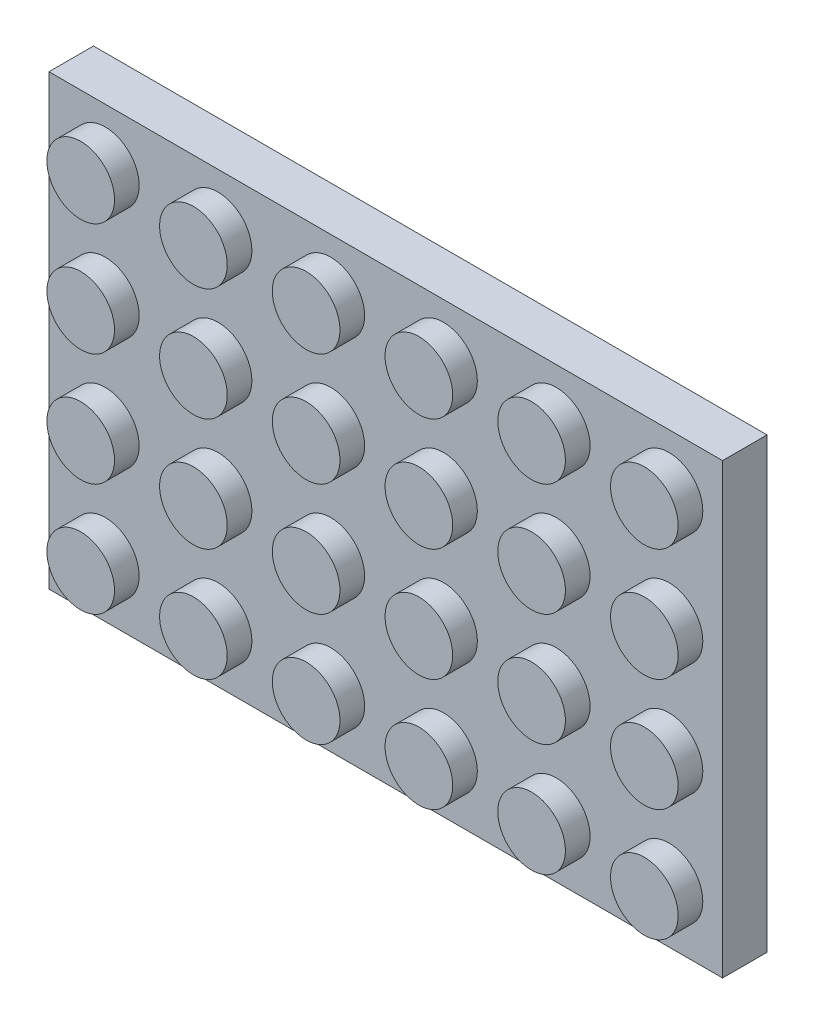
ISO-10303-21;
HEADER;
FILE_DESCRIPTION(('STEP AP214'),'2;1');
FILE_NAME('part.step','',(''),(''),'','','');
FILE_SCHEMA(('AUTOMOTIVE_DESIGN { 1 0 10303 214 1 1 1 1 }'));
ENDSEC;
DATA;
#1=APPLICATION_CONTEXT('core data for automotive mechanical design processes');
#2=APPLICATION_PROTOCOL_DEFINITION('international standard','automotive_design',2000,#1);
#3=PRODUCT_CONTEXT('',#1,'mechanical');
#4=PRODUCT('Part','Part','',(#3));
#5=PRODUCT_RELATED_PRODUCT_CATEGORY('part','',(#4));
#6=PRODUCT_DEFINITION_FORMATION('','',#4);
#7=PRODUCT_DEFINITION_CONTEXT('part definition',#1,'design');
#8=PRODUCT_DEFINITION('design','',#6,#7);
#9=PRODUCT_DEFINITION_SHAPE('','',#8);
#10=(LENGTH_UNIT() NAMED_UNIT(*) SI_UNIT(.MILLI.,.METRE.));
#11=(NAMED_UNIT(*) PLANE_ANGLE_UNIT() SI_UNIT($,.RADIAN.));
#12=(NAMED_UNIT(*) SI_UNIT($,.STERADIAN.) SOLID_ANGLE_UNIT());
#13=UNCERTAINTY_MEASURE_WITH_UNIT(LENGTH_MEASURE(1.E-05),#10,'distance_accuracy_value','');
#14=(GEOMETRIC_REPRESENTATION_CONTEXT(3) GLOBAL_UNCERTAINTY_ASSIGNED_CONTEXT((#13)) GLOBAL_UNIT_ASSIGNED_CONTEXT((#10,
#11,#12)) REPRESENTATION_CONTEXT('',''));
#15=CARTESIAN_POINT('',(0.,0.,0.));
#16=DIRECTION('',(0.,0.,1.));
#17=DIRECTION('',(1.,0.,0.));
#18=AXIS2_PLACEMENT_3D('',#15,#16,#17);
#19=CARTESIAN_POINT('',(-7.07760361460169,-22.4317154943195,-1.16));
#20=DIRECTION('',(0.,0.,-1.));
#21=DIRECTION('',(-1.,0.,0.));
#22=AXIS2_PLACEMENT_3D('',#19,#20,#21);
#23=PLANE('',#22);
#24=DIRECTION('',(0.,1.,0.));
#25=VECTOR('',#24,1.);
#26=CARTESIAN_POINT('',(-7.07760361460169,-22.4317154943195,-1.16));
#27=LINE('',#26,#25);
#28=CARTESIAN_POINT('',(-7.07760361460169,-22.4317154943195,-1.16));
#29=VERTEX_POINT('',#28);
#30=CARTESIAN_POINT('',(-7.07760361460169,6.36828450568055,-1.16));
#31=VERTEX_POINT('',#30);
#32=EDGE_CURVE('E115',#29,#31,#27,.T.);
#33=ORIENTED_EDGE('',*,*,#32,.T.);
#34=DIRECTION('',(1.,0.,0.));
#35=VECTOR('',#34,1.);
#36=CARTESIAN_POINT('',(-7.07760361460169,6.36828450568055,-1.16));
#37=LINE('',#36,#35);
#38=CARTESIAN_POINT('',(37.7223963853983,6.36828450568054,-1.16));
#39=VERTEX_POINT('',#38);
#40=EDGE_CURVE('E124',#31,#39,#37,.T.);
#41=ORIENTED_EDGE('',*,*,#40,.T.);
#42=DIRECTION('',(0.,-1.,0.));
#43=VECTOR('',#42,1.);
#44=CARTESIAN_POINT('',(37.7223963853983,-22.4317154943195,-1.16));
#45=LINE('',#44,#43);
#46=CARTESIAN_POINT('',(37.7223963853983,-22.4317154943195,-1.16));
#47=VERTEX_POINT('',#46);
#48=EDGE_CURVE('E129',#39,#47,#45,.T.);
#49=ORIENTED_EDGE('',*,*,#48,.T.);
#50=DIRECTION('',(-1.,0.,0.));
#51=VECTOR('',#50,1.);
#52=CARTESIAN_POINT('',(-7.07760361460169,-22.4317154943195,-1.16));
#53=LINE('',#52,#51);
#54=EDGE_CURVE('E121',#47,#29,#53,.T.);
#55=ORIENTED_EDGE('',*,*,#54,.T.);
#56=EDGE_LOOP('',(#33,#41,#49,#55));
#57=FACE_BOUND('',#56,.T.);
#58=CARTESIAN_POINT('',(-0.577603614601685,-15.9317154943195,-1.16));
#59=DIRECTION('',(0.,0.,-1.));
#60=DIRECTION('',(-1.,0.,0.));
#61=AXIS2_PLACEMENT_3D('',#58,#59,#60);
#62=CIRCLE('',#61,3.25);
#63=CARTESIAN_POINT('',(-3.82760361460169,-15.9317154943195,-1.16));
#64=VERTEX_POINT('',#63);
#65=EDGE_CURVE('E139',#64,#64,#62,.T.);
#66=ORIENTED_EDGE('',*,*,#65,.F.);
#67=EDGE_LOOP('',(#66));
#68=FACE_BOUND('',#67,.T.);
#69=CARTESIAN_POINT('',(7.42239638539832,-15.9317154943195,-1.16));
#70=DIRECTION('',(0.,0.,-1.));
#71=DIRECTION('',(-1.,0.,0.));
#72=AXIS2_PLACEMENT_3D('',#69,#70,#71);
#73=CIRCLE('',#72,3.25);
#74=CARTESIAN_POINT('',(4.17239638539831,-15.9317154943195,-1.16));
#75=VERTEX_POINT('',#74);
#76=EDGE_CURVE('E640',#75,#75,#73,.T.);
#77=ORIENTED_EDGE('',*,*,#76,.F.);
#78=EDGE_LOOP('',(#77));
#79=FACE_BOUND('',#78,.T.);
#80=CARTESIAN_POINT('',(15.4223963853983,-15.9317154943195,-1.16));
#81=DIRECTION('',(0.,0.,-1.));
#82=DIRECTION('',(-1.,0.,0.));
#83=AXIS2_PLACEMENT_3D('',#80,#81,#82);
#84=CIRCLE('',#83,3.25);
#85=CARTESIAN_POINT('',(12.1723963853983,-15.9317154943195,-1.16));
#86=VERTEX_POINT('',#85);
#87=EDGE_CURVE('E649',#86,#86,#84,.T.);
#88=ORIENTED_EDGE('',*,*,#87,.F.);
#89=EDGE_LOOP('',(#88));
#90=FACE_BOUND('',#89,.T.);
#91=CARTESIAN_POINT('',(23.4223963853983,-15.9317154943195,-1.16));
#92=DIRECTION('',(0.,0.,-1.));
#93=DIRECTION('',(-1.,0.,0.));
#94=AXIS2_PLACEMENT_3D('',#91,#92,#93);
#95=CIRCLE('',#94,3.25);
#96=CARTESIAN_POINT('',(20.1723963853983,-15.9317154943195,-1.16));
#97=VERTEX_POINT('',#96);
#98=EDGE_CURVE('E658',#97,#97,#95,.T.);
#99=ORIENTED_EDGE('',*,*,#98,.F.);
#100=EDGE_LOOP('',(#99));
#101=FACE_BOUND('',#100,.T.);
#102=CARTESIAN_POINT('',(31.4223963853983,-15.9317154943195,-1.16));
#103=DIRECTION('',(0.,0.,-1.));
#104=DIRECTION('',(-1.,0.,0.));
#105=AXIS2_PLACEMENT_3D('',#102,#103,#104);
#106=CIRCLE('',#105,3.25);
#107=CARTESIAN_POINT('',(28.1723963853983,-15.9317154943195,-1.16));
#108=VERTEX_POINT('',#107);
#109=EDGE_CURVE('E667',#108,#108,#106,.T.);
#110=ORIENTED_EDGE('',*,*,#109,.F.);
#111=EDGE_LOOP('',(#110));
#112=FACE_BOUND('',#111,.T.);
#113=CARTESIAN_POINT('',(-0.577603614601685,-7.93171549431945,-1.16));
#114=DIRECTION('',(0.,0.,-1.));
#115=DIRECTION('',(-1.,0.,0.));
#116=AXIS2_PLACEMENT_3D('',#113,#114,#115);
#117=CIRCLE('',#116,3.25);
#118=CARTESIAN_POINT('',(-3.82760361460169,-7.93171549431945,-1.16));
#119=VERTEX_POINT('',#118);
#120=EDGE_CURVE('E676',#119,#119,#117,.T.);
#121=ORIENTED_EDGE('',*,*,#120,.F.);
#122=EDGE_LOOP('',(#121));
#123=FACE_BOUND('',#122,.T.);
#124=CARTESIAN_POINT('',(-0.577603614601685,0.0682845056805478,-1.16));
#125=DIRECTION('',(0.,0.,-1.));
#126=DIRECTION('',(-1.,0.,0.));
#127=AXIS2_PLACEMENT_3D('',#124,#125,#126);
#128=CIRCLE('',#127,3.25);
#129=CARTESIAN_POINT('',(-3.82760361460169,0.0682845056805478,-1.16));
#130=VERTEX_POINT('',#129);
#131=EDGE_CURVE('E685',#130,#130,#128,.T.);
#132=ORIENTED_EDGE('',*,*,#131,.F.);
#133=EDGE_LOOP('',(#132));
#134=FACE_BOUND('',#133,.T.);
#135=CARTESIAN_POINT('',(7.42239638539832,-7.93171549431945,-1.16));
#136=DIRECTION('',(0.,0.,-1.));
#137=DIRECTION('',(-1.,0.,0.));
#138=AXIS2_PLACEMENT_3D('',#135,#136,#137);
#139=CIRCLE('',#138,3.25);
#140=CARTESIAN_POINT('',(4.17239638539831,-7.93171549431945,-1.16));
#141=VERTEX_POINT('',#140);
#142=EDGE_CURVE('E694',#141,#141,#139,.T.);
#143=ORIENTED_EDGE('',*,*,#142,.F.);
#144=EDGE_LOOP('',(#143));
#145=FACE_BOUND('',#144,.T.);
#146=CARTESIAN_POINT('',(15.4223963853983,-7.93171549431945,-1.16));
#147=DIRECTION('',(0.,0.,-1.));
#148=DIRECTION('',(-1.,0.,0.));
#149=AXIS2_PLACEMENT_3D('',#146,#147,#148);
#150=CIRCLE('',#149,3.25);
#151=CARTESIAN_POINT('',(12.1723963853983,-7.93171549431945,-1.16));
#152=VERTEX_POINT('',#151);
#153=EDGE_CURVE('E703',#152,#152,#150,.T.);
#154=ORIENTED_EDGE('',*,*,#153,.F.);
#155=EDGE_LOOP('',(#154));
#156=FACE_BOUND('',#155,.T.);
#157=CARTESIAN_POINT('',(23.4223963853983,-7.93171549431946,-1.16));
#158=DIRECTION('',(0.,0.,-1.));
#159=DIRECTION('',(-1.,0.,0.));
#160=AXIS2_PLACEMENT_3D('',#157,#158,#159);
#161=CIRCLE('',#160,3.25);
#162=CARTESIAN_POINT('',(20.1723963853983,-7.93171549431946,-1.16));
#163=VERTEX_POINT('',#162);
#164=EDGE_CURVE('E712',#163,#163,#161,.T.);
#165=ORIENTED_EDGE('',*,*,#164,.F.);
#166=EDGE_LOOP('',(#165));
#167=FACE_BOUND('',#166,.T.);
#168=CARTESIAN_POINT('',(31.4223963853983,-7.93171549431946,-1.16));
#169=DIRECTION('',(0.,0.,-1.));
#170=DIRECTION('',(-1.,0.,0.));
#171=AXIS2_PLACEMENT_3D('',#168,#169,#170);
#172=CIRCLE('',#171,3.25);
#173=CARTESIAN_POINT('',(28.1723963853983,-7.93171549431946,-1.16));
#174=VERTEX_POINT('',#173);
#175=EDGE_CURVE('E721',#174,#174,#172,.T.);
#176=ORIENTED_EDGE('',*,*,#175,.F.);
#177=EDGE_LOOP('',(#176));
#178=FACE_BOUND('',#177,.T.);
#179=CARTESIAN_POINT('',(7.42239638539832,0.0682845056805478,-1.16));
#180=DIRECTION('',(0.,0.,-1.));
#181=DIRECTION('',(-1.,0.,0.));
#182=AXIS2_PLACEMENT_3D('',#179,#180,#181);
#183=CIRCLE('',#182,3.25);
#184=CARTESIAN_POINT('',(4.17239638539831,0.0682845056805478,-1.16));
#185=VERTEX_POINT('',#184);
#186=EDGE_CURVE('E730',#185,#185,#183,.T.);
#187=ORIENTED_EDGE('',*,*,#186,.F.);
#188=EDGE_LOOP('',(#187));
#189=FACE_BOUND('',#188,.T.);
#190=CARTESIAN_POINT('',(15.4223963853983,0.0682845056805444,-1.16));
#191=DIRECTION('',(0.,0.,-1.));
#192=DIRECTION('',(-1.,0.,0.));
#193=AXIS2_PLACEMENT_3D('',#190,#191,#192);
#194=CIRCLE('',#193,3.25);
#195=CARTESIAN_POINT('',(12.1723963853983,0.0682845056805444,-1.16));
#196=VERTEX_POINT('',#195);
#197=EDGE_CURVE('E738',#196,#196,#194,.T.);
#198=ORIENTED_EDGE('',*,*,#197,.F.);
#199=EDGE_LOOP('',(#198));
#200=FACE_BOUND('',#199,.T.);
#201=CARTESIAN_POINT('',(23.4223963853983,0.0682845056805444,-1.16));
#202=DIRECTION('',(0.,0.,-1.));
#203=DIRECTION('',(-1.,0.,0.));
#204=AXIS2_PLACEMENT_3D('',#201,#202,#203);
#205=CIRCLE('',#204,3.25);
#206=CARTESIAN_POINT('',(20.1723963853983,0.0682845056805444,-1.16));
#207=VERTEX_POINT('',#206);
#208=EDGE_CURVE('E747',#207,#207,#205,.T.);
#209=ORIENTED_EDGE('',*,*,#208,.F.);
#210=EDGE_LOOP('',(#209));
#211=FACE_BOUND('',#210,.T.);
#212=CARTESIAN_POINT('',(31.4223963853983,0.0682845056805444,-1.16));
#213=DIRECTION('',(0.,0.,-1.));
#214=DIRECTION('',(-1.,0.,0.));
#215=AXIS2_PLACEMENT_3D('',#212,#213,#214);
#216=CIRCLE('',#215,3.25);
#217=CARTESIAN_POINT('',(28.1723963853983,0.0682845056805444,-1.16));
#218=VERTEX_POINT('',#217);
#219=EDGE_CURVE('E756',#218,#218,#216,.T.);
#220=ORIENTED_EDGE('',*,*,#219,.F.);
#221=EDGE_LOOP('',(#220));
#222=FACE_BOUND('',#221,.T.);
#223=ADVANCED_FACE('F39',(#57,#68,#79,#90,#101,#112,#123,#134,#145,#156,#167,#178,#189,#200,
#211,#222),#23,.T.);
#224=CARTESIAN_POINT('',(-8.57760361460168,-23.9317154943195,0.));
#225=DIRECTION('',(0.,0.,1.));
#226=DIRECTION('',(1.,0.,0.));
#227=AXIS2_PLACEMENT_3D('',#224,#225,#226);
#228=PLANE('',#227);
#229=CARTESIAN_POINT('',(27.4223963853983,-3.93171549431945,0.));
#230=DIRECTION('',(0.,0.,1.));
#231=DIRECTION('',(1.,0.,0.));
#232=AXIS2_PLACEMENT_3D('',#229,#230,#231);
#233=CIRCLE('',#232,2.4);
#234=CARTESIAN_POINT('',(29.8223963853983,-3.93171549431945,0.));
#235=VERTEX_POINT('',#234);
#236=EDGE_CURVE('E236',#235,#235,#233,.T.);
#237=ORIENTED_EDGE('',*,*,#236,.F.);
#238=EDGE_LOOP('',(#237));
#239=FACE_BOUND('',#238,.T.);
#240=CARTESIAN_POINT('',(19.4223963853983,-3.93171549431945,0.));
#241=DIRECTION('',(0.,0.,1.));
#242=DIRECTION('',(1.,0.,0.));
#243=AXIS2_PLACEMENT_3D('',#240,#241,#242);
#244=CIRCLE('',#243,2.4);
#245=CARTESIAN_POINT('',(21.8223963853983,-3.93171549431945,0.));
#246=VERTEX_POINT('',#245);
#247=EDGE_CURVE('E230',#246,#246,#244,.T.);
#248=ORIENTED_EDGE('',*,*,#247,.F.);
#249=EDGE_LOOP('',(#248));
#250=FACE_BOUND('',#249,.T.);
#251=CARTESIAN_POINT('',(11.4223963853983,-3.93171549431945,0.));
#252=DIRECTION('',(0.,0.,1.));
#253=DIRECTION('',(1.,0.,0.));
#254=AXIS2_PLACEMENT_3D('',#251,#252,#253);
#255=CIRCLE('',#254,2.4);
#256=CARTESIAN_POINT('',(13.8223963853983,-3.93171549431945,0.));
#257=VERTEX_POINT('',#256);
#258=EDGE_CURVE('E224',#257,#257,#255,.T.);
#259=ORIENTED_EDGE('',*,*,#258,.F.);
#260=EDGE_LOOP('',(#259));
#261=FACE_BOUND('',#260,.T.);
#262=CARTESIAN_POINT('',(3.42239638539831,-3.93171549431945,0.));
#263=DIRECTION('',(0.,0.,1.));
#264=DIRECTION('',(1.,0.,0.));
#265=AXIS2_PLACEMENT_3D('',#262,#263,#264);
#266=CIRCLE('',#265,2.4);
#267=CARTESIAN_POINT('',(5.82239638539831,-3.93171549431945,0.));
#268=VERTEX_POINT('',#267);
#269=EDGE_CURVE('E218',#268,#268,#266,.T.);
#270=ORIENTED_EDGE('',*,*,#269,.F.);
#271=EDGE_LOOP('',(#270));
#272=FACE_BOUND('',#271,.T.);
#273=CARTESIAN_POINT('',(27.4223963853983,-11.9317154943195,0.));
#274=DIRECTION('',(0.,0.,1.));
#275=DIRECTION('',(1.,0.,0.));
#276=AXIS2_PLACEMENT_3D('',#273,#274,#275);
#277=CIRCLE('',#276,2.4);
#278=CARTESIAN_POINT('',(29.8223963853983,-11.9317154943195,0.));
#279=VERTEX_POINT('',#278);
#280=EDGE_CURVE('E212',#279,#279,#277,.T.);
#281=ORIENTED_EDGE('',*,*,#280,.F.);
#282=EDGE_LOOP('',(#281));
#283=FACE_BOUND('',#282,.T.);
#284=CARTESIAN_POINT('',(19.4223963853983,-11.9317154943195,0.));
#285=DIRECTION('',(0.,0.,1.));
#286=DIRECTION('',(1.,0.,0.));
#287=AXIS2_PLACEMENT_3D('',#284,#285,#286);
#288=CIRCLE('',#287,2.4);
#289=CARTESIAN_POINT('',(21.8223963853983,-11.9317154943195,0.));
#290=VERTEX_POINT('',#289);
#291=EDGE_CURVE('E206',#290,#290,#288,.T.);
#292=ORIENTED_EDGE('',*,*,#291,.F.);
#293=EDGE_LOOP('',(#292));
#294=FACE_BOUND('',#293,.T.);
#295=CARTESIAN_POINT('',(11.4223963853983,-11.9317154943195,0.));
#296=DIRECTION('',(0.,0.,1.));
#297=DIRECTION('',(1.,0.,0.));
#298=AXIS2_PLACEMENT_3D('',#295,#296,#297);
#299=CIRCLE('',#298,2.4);
#300=CARTESIAN_POINT('',(13.8223963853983,-11.9317154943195,0.));
#301=VERTEX_POINT('',#300);
#302=EDGE_CURVE('E195',#301,#301,#299,.T.);
#303=ORIENTED_EDGE('',*,*,#302,.F.);
#304=EDGE_LOOP('',(#303));
#305=FACE_BOUND('',#304,.T.);
#306=CARTESIAN_POINT('',(3.42239638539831,-11.9317154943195,0.));
#307=DIRECTION('',(0.,0.,1.));
#308=DIRECTION('',(1.,0.,0.));
#309=AXIS2_PLACEMENT_3D('',#306,#307,#308);
#310=CIRCLE('',#309,2.4);
#311=CARTESIAN_POINT('',(5.82239638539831,-11.9317154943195,0.));
#312=VERTEX_POINT('',#311);
#313=EDGE_CURVE('E161',#312,#312,#310,.T.);
#314=ORIENTED_EDGE('',*,*,#313,.F.);
#315=EDGE_LOOP('',(#314));
#316=FACE_BOUND('',#315,.T.);
#317=DIRECTION('',(0.,-1.,0.));
#318=VECTOR('',#317,1.);
#319=CARTESIAN_POINT('',(-8.57760361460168,7.86828450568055,0.));
#320=LINE('',#319,#318);
#321=CARTESIAN_POINT('',(-8.57760361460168,7.86828450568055,0.));
#322=VERTEX_POINT('',#321);
#323=CARTESIAN_POINT('',(-8.57760361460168,-23.9317154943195,0.));
#324=VERTEX_POINT('',#323);
#325=EDGE_CURVE('E171',#322,#324,#320,.T.);
#326=ORIENTED_EDGE('',*,*,#325,.T.);
#327=DIRECTION('',(1.,0.,0.));
#328=VECTOR('',#327,1.);
#329=CARTESIAN_POINT('',(-8.57760361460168,-23.9317154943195,0.));
#330=LINE('',#329,#328);
#331=CARTESIAN_POINT('',(39.2223963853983,-23.9317154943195,0.));
#332=VERTEX_POINT('',#331);
#333=EDGE_CURVE('E186',#324,#332,#330,.T.);
#334=ORIENTED_EDGE('',*,*,#333,.T.);
#335=DIRECTION('',(0.,1.,0.));
#336=VECTOR('',#335,1.);
#337=CARTESIAN_POINT('',(39.2223963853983,7.86828450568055,0.));
#338=LINE('',#337,#336);
#339=CARTESIAN_POINT('',(39.2223963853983,7.86828450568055,0.));
#340=VERTEX_POINT('',#339);
#341=EDGE_CURVE('E189',#332,#340,#338,.T.);
#342=ORIENTED_EDGE('',*,*,#341,.T.);
#343=DIRECTION('',(-1.,0.,0.));
#344=VECTOR('',#343,1.);
#345=CARTESIAN_POINT('',(-8.57760361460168,7.86828450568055,0.));
#346=LINE('',#345,#344);
#347=EDGE_CURVE('E177',#340,#322,#346,.T.);
#348=ORIENTED_EDGE('',*,*,#347,.T.);
#349=EDGE_LOOP('',(#326,#334,#342,#348));
#350=FACE_BOUND('',#349,.T.);
#351=CARTESIAN_POINT('',(-4.57760361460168,-19.9317154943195,0.));
#352=DIRECTION('',(0.,0.,1.));
#353=DIRECTION('',(1.,0.,0.));
#354=AXIS2_PLACEMENT_3D('',#351,#352,#353);
#355=CIRCLE('',#354,2.4);
#356=CARTESIAN_POINT('',(-2.17760361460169,-19.9317154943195,0.));
#357=VERTEX_POINT('',#356);
#358=EDGE_CURVE('E167',#357,#357,#355,.T.);
#359=ORIENTED_EDGE('',*,*,#358,.F.);
#360=EDGE_LOOP('',(#359));
#361=FACE_BOUND('',#360,.T.);
#362=CARTESIAN_POINT('',(3.42239638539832,-19.9317154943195,0.));
#363=DIRECTION('',(0.,0.,1.));
#364=DIRECTION('',(1.,0.,0.));
#365=AXIS2_PLACEMENT_3D('',#362,#363,#364);
#366=CIRCLE('',#365,2.4);
#367=CARTESIAN_POINT('',(5.82239638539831,-19.9317154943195,0.));
#368=VERTEX_POINT('',#367);
#369=EDGE_CURVE('E152',#368,#368,#366,.T.);
#370=ORIENTED_EDGE('',*,*,#369,.F.);
#371=EDGE_LOOP('',(#370));
#372=FACE_BOUND('',#371,.T.);
#373=CARTESIAN_POINT('',(11.4223963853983,-19.9317154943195,0.));
#374=DIRECTION('',(0.,0.,1.));
#375=DIRECTION('',(1.,0.,0.));
#376=AXIS2_PLACEMENT_3D('',#373,#374,#375);
#377=CIRCLE('',#376,2.4);
#378=CARTESIAN_POINT('',(13.8223963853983,-19.9317154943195,0.));
#379=VERTEX_POINT('',#378);
#380=EDGE_CURVE('E242',#379,#379,#377,.T.);
#381=ORIENTED_EDGE('',*,*,#380,.F.);
#382=EDGE_LOOP('',(#381));
#383=FACE_BOUND('',#382,.T.);
#384=CARTESIAN_POINT('',(19.4223963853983,-19.9317154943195,0.));
#385=DIRECTION('',(0.,0.,1.));
#386=DIRECTION('',(1.,0.,0.));
#387=AXIS2_PLACEMENT_3D('',#384,#385,#386);
#388=CIRCLE('',#387,2.4);
#389=CARTESIAN_POINT('',(21.8223963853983,-19.9317154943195,0.));
#390=VERTEX_POINT('',#389);
#391=EDGE_CURVE('E248',#390,#390,#388,.T.);
#392=ORIENTED_EDGE('',*,*,#391,.F.);
#393=EDGE_LOOP('',(#392));
#394=FACE_BOUND('',#393,.T.);
#395=CARTESIAN_POINT('',(27.4223963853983,-19.9317154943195,0.));
#396=DIRECTION('',(0.,0.,1.));
#397=DIRECTION('',(1.,0.,0.));
#398=AXIS2_PLACEMENT_3D('',#395,#396,#397);
#399=CIRCLE('',#398,2.4);
#400=CARTESIAN_POINT('',(29.8223963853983,-19.9317154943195,0.));
#401=VERTEX_POINT('',#400);
#402=EDGE_CURVE('E254',#401,#401,#399,.T.);
#403=ORIENTED_EDGE('',*,*,#402,.F.);
#404=EDGE_LOOP('',(#403));
#405=FACE_BOUND('',#404,.T.);
#406=CARTESIAN_POINT('',(35.4223963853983,-19.9317154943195,0.));
#407=DIRECTION('',(0.,0.,1.));
#408=DIRECTION('',(1.,0.,0.));
#409=AXIS2_PLACEMENT_3D('',#406,#407,#408);
#410=CIRCLE('',#409,2.4);
#411=CARTESIAN_POINT('',(37.8223963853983,-19.9317154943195,0.));
#412=VERTEX_POINT('',#411);
#413=EDGE_CURVE('E260',#412,#412,#410,.T.);
#414=ORIENTED_EDGE('',*,*,#413,.F.);
#415=EDGE_LOOP('',(#414));
#416=FACE_BOUND('',#415,.T.);
#417=CARTESIAN_POINT('',(-4.57760361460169,-11.9317154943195,0.));
#418=DIRECTION('',(0.,0.,1.));
#419=DIRECTION('',(1.,0.,0.));
#420=AXIS2_PLACEMENT_3D('',#417,#418,#419);
#421=CIRCLE('',#420,2.4);
#422=CARTESIAN_POINT('',(-2.17760361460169,-11.9317154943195,0.));
#423=VERTEX_POINT('',#422);
#424=EDGE_CURVE('E266',#423,#423,#421,.T.);
#425=ORIENTED_EDGE('',*,*,#424,.F.);
#426=EDGE_LOOP('',(#425));
#427=FACE_BOUND('',#426,.T.);
#428=CARTESIAN_POINT('',(35.4223963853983,-11.9317154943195,0.));
#429=DIRECTION('',(0.,0.,1.));
#430=DIRECTION('',(1.,0.,0.));
#431=AXIS2_PLACEMENT_3D('',#428,#429,#430);
#432=CIRCLE('',#431,2.4);
#433=CARTESIAN_POINT('',(37.8223963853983,-11.9317154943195,0.));
#434=VERTEX_POINT('',#433);
#435=EDGE_CURVE('E272',#434,#434,#432,.T.);
#436=ORIENTED_EDGE('',*,*,#435,.F.);
#437=EDGE_LOOP('',(#436));
#438=FACE_BOUND('',#437,.T.);
#439=CARTESIAN_POINT('',(-4.57760361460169,-3.93171549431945,0.));
#440=DIRECTION('',(0.,0.,1.));
#441=DIRECTION('',(1.,0.,0.));
#442=AXIS2_PLACEMENT_3D('',#439,#440,#441);
#443=CIRCLE('',#442,2.4);
#444=CARTESIAN_POINT('',(-2.17760361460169,-3.93171549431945,0.));
#445=VERTEX_POINT('',#444);
#446=EDGE_CURVE('E278',#445,#445,#443,.T.);
#447=ORIENTED_EDGE('',*,*,#446,.F.);
#448=EDGE_LOOP('',(#447));
#449=FACE_BOUND('',#448,.T.);
#450=CARTESIAN_POINT('',(35.4223963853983,-3.93171549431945,0.));
#451=DIRECTION('',(0.,0.,1.));
#452=DIRECTION('',(1.,0.,0.));
#453=AXIS2_PLACEMENT_3D('',#450,#451,#452);
#454=CIRCLE('',#453,2.4);
#455=CARTESIAN_POINT('',(37.8223963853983,-3.93171549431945,0.));
#456=VERTEX_POINT('',#455);
#457=EDGE_CURVE('E284',#456,#456,#454,.T.);
#458=ORIENTED_EDGE('',*,*,#457,.F.);
#459=EDGE_LOOP('',(#458));
#460=FACE_BOUND('',#459,.T.);
#461=CARTESIAN_POINT('',(-4.57760361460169,4.06828450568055,0.));
#462=DIRECTION('',(0.,0.,1.));
#463=DIRECTION('',(1.,0.,0.));
#464=AXIS2_PLACEMENT_3D('',#461,#462,#463);
#465=CIRCLE('',#464,2.4);
#466=CARTESIAN_POINT('',(-2.17760361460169,4.06828450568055,0.));
#467=VERTEX_POINT('',#466);
#468=EDGE_CURVE('E290',#467,#467,#465,.T.);
#469=ORIENTED_EDGE('',*,*,#468,.F.);
#470=EDGE_LOOP('',(#469));
#471=FACE_BOUND('',#470,.T.);
#472=CARTESIAN_POINT('',(3.42239638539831,4.06828450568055,0.));
#473=DIRECTION('',(0.,0.,1.));
#474=DIRECTION('',(1.,0.,0.));
#475=AXIS2_PLACEMENT_3D('',#472,#473,#474);
#476=CIRCLE('',#475,2.4);
#477=CARTESIAN_POINT('',(5.82239638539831,4.06828450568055,0.));
#478=VERTEX_POINT('',#477);
#479=EDGE_CURVE('E296',#478,#478,#476,.T.);
#480=ORIENTED_EDGE('',*,*,#479,.F.);
#481=EDGE_LOOP('',(#480));
#482=FACE_BOUND('',#481,.T.);
#483=CARTESIAN_POINT('',(11.4223963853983,4.06828450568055,0.));
#484=DIRECTION('',(0.,0.,1.));
#485=DIRECTION('',(1.,0.,0.));
#486=AXIS2_PLACEMENT_3D('',#483,#484,#485);
#487=CIRCLE('',#486,2.4);
#488=CARTESIAN_POINT('',(13.8223963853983,4.06828450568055,0.));
#489=VERTEX_POINT('',#488);
#490=EDGE_CURVE('E302',#489,#489,#487,.T.);
#491=ORIENTED_EDGE('',*,*,#490,.F.);
#492=EDGE_LOOP('',(#491));
#493=FACE_BOUND('',#492,.T.);
#494=CARTESIAN_POINT('',(19.4223963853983,4.06828450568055,0.));
#495=DIRECTION('',(0.,0.,1.));
#496=DIRECTION('',(1.,0.,0.));
#497=AXIS2_PLACEMENT_3D('',#494,#495,#496);
#498=CIRCLE('',#497,2.4);
#499=CARTESIAN_POINT('',(21.8223963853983,4.06828450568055,0.));
#500=VERTEX_POINT('',#499);
#501=EDGE_CURVE('E308',#500,#500,#498,.T.);
#502=ORIENTED_EDGE('',*,*,#501,.F.);
#503=EDGE_LOOP('',(#502));
#504=FACE_BOUND('',#503,.T.);
#505=CARTESIAN_POINT('',(27.4223963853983,4.06828450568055,0.));
#506=DIRECTION('',(0.,0.,1.));
#507=DIRECTION('',(1.,0.,0.));
#508=AXIS2_PLACEMENT_3D('',#505,#506,#507);
#509=CIRCLE('',#508,2.4);
#510=CARTESIAN_POINT('',(29.8223963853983,4.06828450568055,0.));
#511=VERTEX_POINT('',#510);
#512=EDGE_CURVE('E314',#511,#511,#509,.T.);
#513=ORIENTED_EDGE('',*,*,#512,.F.);
#514=EDGE_LOOP('',(#513));
#515=FACE_BOUND('',#514,.T.);
#516=CARTESIAN_POINT('',(35.4223963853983,4.06828450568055,0.));
#517=DIRECTION('',(0.,0.,1.));
#518=DIRECTION('',(1.,0.,0.));
#519=AXIS2_PLACEMENT_3D('',#516,#517,#518);
#520=CIRCLE('',#519,2.4);
#521=CARTESIAN_POINT('',(37.8223963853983,4.06828450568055,0.));
#522=VERTEX_POINT('',#521);
#523=EDGE_CURVE('E320',#522,#522,#520,.T.);
#524=ORIENTED_EDGE('',*,*,#523,.F.);
#525=EDGE_LOOP('',(#524));
#526=FACE_BOUND('',#525,.T.);
#527=ADVANCED_FACE('F397',(#239,#250,#261,#272,#283,#294,#305,#316,#350,#361,#372,#383,#394,
#405,#416,#427,#438,#449,#460,#471,#482,#493,#504,#515,#526),#228,.T.);
#528=CARTESIAN_POINT('',(-8.57760361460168,7.86828450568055,-3.16));
#529=DIRECTION('',(-1.,0.,0.));
#530=DIRECTION('',(0.,-1.,0.));
#531=AXIS2_PLACEMENT_3D('',#528,#529,#530);
#532=PLANE('',#531);
#533=ORIENTED_EDGE('',*,*,#325,.F.);
#534=DIRECTION('',(0.,0.,1.));
#535=VECTOR('',#534,1.);
#536=CARTESIAN_POINT('',(-8.57760361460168,7.86828450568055,-3.16));
#537=LINE('',#536,#535);
#538=CARTESIAN_POINT('',(-8.57760361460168,7.86828450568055,-3.16));
#539=VERTEX_POINT('',#538);
#540=EDGE_CURVE('E63',#539,#322,#537,.T.);
#541=ORIENTED_EDGE('',*,*,#540,.F.);
#542=DIRECTION('',(0.,-1.,0.));
#543=VECTOR('',#542,1.);
#544=CARTESIAN_POINT('',(-8.57760361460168,7.86828450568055,-3.16));
#545=LINE('',#544,#543);
#546=CARTESIAN_POINT('',(-8.57760361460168,-23.9317154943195,-3.16));
#547=VERTEX_POINT('',#546);
#548=EDGE_CURVE('E174',#539,#547,#545,.T.);
#549=ORIENTED_EDGE('',*,*,#548,.T.);
#550=DIRECTION('',(0.,0.,1.));
#551=VECTOR('',#550,1.);
#552=CARTESIAN_POINT('',(-8.57760361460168,-23.9317154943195,-3.16));
#553=LINE('',#552,#551);
#554=EDGE_CURVE('E89',#547,#324,#553,.T.);
#555=ORIENTED_EDGE('',*,*,#554,.T.);
#556=EDGE_LOOP('',(#533,#541,#549,#555));
#557=FACE_BOUND('',#556,.T.);
#558=ADVANCED_FACE('F401',(#557),#532,.T.);
#559=CARTESIAN_POINT('',(-8.57760361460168,7.86828450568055,-3.16));
#560=DIRECTION('',(0.,1.,0.));
#561=DIRECTION('',(0.,0.,1.));
#562=AXIS2_PLACEMENT_3D('',#559,#560,#561);
#563=PLANE('',#562);
#564=ORIENTED_EDGE('',*,*,#347,.F.);
#565=DIRECTION('',(0.,0.,1.));
#566=VECTOR('',#565,1.);
#567=CARTESIAN_POINT('',(39.2223963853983,7.86828450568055,-3.16));
#568=LINE('',#567,#566);
#569=CARTESIAN_POINT('',(39.2223963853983,7.86828450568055,-3.16));
#570=VERTEX_POINT('',#569);
#571=EDGE_CURVE('E196',#570,#340,#568,.T.);
#572=ORIENTED_EDGE('',*,*,#571,.F.);
#573=DIRECTION('',(-1.,0.,0.));
#574=VECTOR('',#573,1.);
#575=CARTESIAN_POINT('',(-8.57760361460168,7.86828450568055,-3.16));
#576=LINE('',#575,#574);
#577=EDGE_CURVE('E182',#570,#539,#576,.T.);
#578=ORIENTED_EDGE('',*,*,#577,.T.);
#579=ORIENTED_EDGE('',*,*,#540,.T.);
#580=EDGE_LOOP('',(#564,#572,#578,#579));
#581=FACE_BOUND('',#580,.T.);
#582=ADVANCED_FACE('F1790',(#581),#563,.T.);
#583=CARTESIAN_POINT('',(39.2223963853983,7.86828450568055,-3.16));
#584=DIRECTION('',(1.,0.,0.));
#585=DIRECTION('',(0.,1.,0.));
#586=AXIS2_PLACEMENT_3D('',#583,#584,#585);
#587=PLANE('',#586);
#588=ORIENTED_EDGE('',*,*,#341,.F.);
#589=DIRECTION('',(0.,0.,1.));
#590=VECTOR('',#589,1.);
#591=CARTESIAN_POINT('',(39.2223963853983,-23.9317154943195,-3.16));
#592=LINE('',#591,#590);
#593=CARTESIAN_POINT('',(39.2223963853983,-23.9317154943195,-3.16));
#594=VERTEX_POINT('',#593);
#595=EDGE_CURVE('E198',#594,#332,#592,.T.);
#596=ORIENTED_EDGE('',*,*,#595,.F.);
#597=DIRECTION('',(0.,1.,0.));
#598=VECTOR('',#597,1.);
#599=CARTESIAN_POINT('',(39.2223963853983,7.86828450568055,-3.16));
#600=LINE('',#599,#598);
#601=EDGE_CURVE('E179',#594,#570,#600,.T.);
#602=ORIENTED_EDGE('',*,*,#601,.T.);
#603=ORIENTED_EDGE('',*,*,#571,.T.);
#604=EDGE_LOOP('',(#588,#596,#602,#603));
#605=FACE_BOUND('',#604,.T.);
#606=ADVANCED_FACE('F1781',(#605),#587,.T.);
#607=CARTESIAN_POINT('',(-8.57760361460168,-23.9317154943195,-3.16));
#608=DIRECTION('',(0.,-1.,0.));
#609=DIRECTION('',(0.,0.,-1.));
#610=AXIS2_PLACEMENT_3D('',#607,#608,#609);
#611=PLANE('',#610);
#612=ORIENTED_EDGE('',*,*,#333,.F.);
#613=ORIENTED_EDGE('',*,*,#554,.F.);
#614=DIRECTION('',(1.,0.,0.));
#615=VECTOR('',#614,1.);
#616=CARTESIAN_POINT('',(-8.57760361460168,-23.9317154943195,-3.16));
#617=LINE('',#616,#615);
#618=EDGE_CURVE('E176',#547,#594,#617,.T.);
#619=ORIENTED_EDGE('',*,*,#618,.T.);
#620=ORIENTED_EDGE('',*,*,#595,.T.);
#621=EDGE_LOOP('',(#612,#613,#619,#620));
#622=FACE_BOUND('',#621,.T.);
#623=ADVANCED_FACE('F1291',(#622),#611,.T.);
#624=CARTESIAN_POINT('',(-8.57760361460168,-23.9317154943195,-3.16));
#625=DIRECTION('',(0.,0.,1.));
#626=DIRECTION('',(1.,0.,0.));
#627=AXIS2_PLACEMENT_3D('',#624,#625,#626);
#628=PLANE('',#627);
#629=DIRECTION('',(1.,0.,0.));
#630=VECTOR('',#629,1.);
#631=CARTESIAN_POINT('',(-7.07760361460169,6.36828450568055,-3.16));
#632=LINE('',#631,#630);
#633=CARTESIAN_POINT('',(-7.07760361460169,6.36828450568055,-3.16));
#634=VERTEX_POINT('',#633);
#635=CARTESIAN_POINT('',(37.7223963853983,6.36828450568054,-3.16));
#636=VERTEX_POINT('',#635);
#637=EDGE_CURVE('E145',#634,#636,#632,.T.);
#638=ORIENTED_EDGE('',*,*,#637,.F.);
#639=DIRECTION('',(0.,1.,0.));
#640=VECTOR('',#639,1.);
#641=CARTESIAN_POINT('',(-7.07760361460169,-22.4317154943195,-3.16));
#642=LINE('',#641,#640);
#643=CARTESIAN_POINT('',(-7.07760361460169,-22.4317154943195,-3.16));
#644=VERTEX_POINT('',#643);
#645=EDGE_CURVE('E54',#644,#634,#642,.T.);
#646=ORIENTED_EDGE('',*,*,#645,.F.);
#647=DIRECTION('',(-1.,0.,0.));
#648=VECTOR('',#647,1.);
#649=CARTESIAN_POINT('',(-7.07760361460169,-22.4317154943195,-3.16));
#650=LINE('',#649,#648);
#651=CARTESIAN_POINT('',(37.7223963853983,-22.4317154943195,-3.16));
#652=VERTEX_POINT('',#651);
#653=EDGE_CURVE('E133',#652,#644,#650,.T.);
#654=ORIENTED_EDGE('',*,*,#653,.F.);
#655=DIRECTION('',(0.,-1.,0.));
#656=VECTOR('',#655,1.);
#657=CARTESIAN_POINT('',(37.7223963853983,-22.4317154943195,-3.16));
#658=LINE('',#657,#656);
#659=EDGE_CURVE('E136',#636,#652,#658,.T.);
#660=ORIENTED_EDGE('',*,*,#659,.F.);
#661=EDGE_LOOP('',(#638,#646,#654,#660));
#662=FACE_BOUND('',#661,.T.);
#663=ORIENTED_EDGE('',*,*,#548,.F.);
#664=ORIENTED_EDGE('',*,*,#577,.F.);
#665=ORIENTED_EDGE('',*,*,#601,.F.);
#666=ORIENTED_EDGE('',*,*,#618,.F.);
#667=EDGE_LOOP('',(#663,#664,#665,#666));
#668=FACE_BOUND('',#667,.T.);
#669=ADVANCED_FACE('F1285',(#662,#668),#628,.F.);
#670=CARTESIAN_POINT('',(-4.57760361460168,-19.9317154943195,1.75));
#671=DIRECTION('',(0.,0.,-1.));
#672=DIRECTION('',(-1.,0.,0.));
#673=AXIS2_PLACEMENT_3D('',#670,#671,#672);
#674=CYLINDRICAL_SURFACE('',#673,2.4);
#675=CARTESIAN_POINT('',(-4.57760361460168,-19.9317154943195,1.75));
#676=DIRECTION('',(0.,0.,1.));
#677=DIRECTION('',(1.,0.,0.));
#678=AXIS2_PLACEMENT_3D('',#675,#676,#677);
#679=CIRCLE('',#678,2.4);
#680=CARTESIAN_POINT('',(-2.17760361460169,-19.9317154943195,1.75));
#681=VERTEX_POINT('',#680);
#682=EDGE_CURVE('E168',#681,#681,#679,.T.);
#683=ORIENTED_EDGE('',*,*,#682,.F.);
#684=EDGE_LOOP('',(#683));
#685=FACE_BOUND('',#684,.T.);
#686=ORIENTED_EDGE('',*,*,#358,.T.);
#687=EDGE_LOOP('',(#686));
#688=FACE_BOUND('',#687,.T.);
#689=ADVANCED_FACE('F1290',(#685,#688),#674,.T.);
#690=CARTESIAN_POINT('',(-4.57760361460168,-19.9317154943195,1.75));
#691=DIRECTION('',(0.,0.,1.));
#692=DIRECTION('',(1.,0.,0.));
#693=AXIS2_PLACEMENT_3D('',#690,#691,#692);
#694=PLANE('',#693);
#695=ORIENTED_EDGE('',*,*,#682,.T.);
#696=EDGE_LOOP('',(#695));
#697=FACE_BOUND('',#696,.T.);
#698=ADVANCED_FACE('F1743',(#697),#694,.T.);
#699=CARTESIAN_POINT('',(3.42239638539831,-11.9317154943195,1.75));
#700=DIRECTION('',(0.,0.,-1.));
#701=DIRECTION('',(-1.,0.,0.));
#702=AXIS2_PLACEMENT_3D('',#699,#700,#701);
#703=CYLINDRICAL_SURFACE('',#702,2.4);
#704=CARTESIAN_POINT('',(3.42239638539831,-11.9317154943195,1.75));
#705=DIRECTION('',(0.,0.,1.));
#706=DIRECTION('',(1.,0.,0.));
#707=AXIS2_PLACEMENT_3D('',#704,#705,#706);
#708=CIRCLE('',#707,2.4);
#709=CARTESIAN_POINT('',(5.82239638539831,-11.9317154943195,1.75));
#710=VERTEX_POINT('',#709);
#711=EDGE_CURVE('E164',#710,#710,#708,.T.);
#712=ORIENTED_EDGE('',*,*,#711,.F.);
#713=EDGE_LOOP('',(#712));
#714=FACE_BOUND('',#713,.T.);
#715=ORIENTED_EDGE('',*,*,#313,.T.);
#716=EDGE_LOOP('',(#715));
#717=FACE_BOUND('',#716,.T.);
#718=ADVANCED_FACE('F1733',(#714,#717),#703,.T.);
#719=CARTESIAN_POINT('',(3.42239638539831,-11.9317154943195,1.75));
#720=DIRECTION('',(0.,0.,1.));
#721=DIRECTION('',(1.,0.,0.));
#722=AXIS2_PLACEMENT_3D('',#719,#720,#721);
#723=PLANE('',#722);
#724=ORIENTED_EDGE('',*,*,#711,.T.);
#725=EDGE_LOOP('',(#724));
#726=FACE_BOUND('',#725,.T.);
#727=ADVANCED_FACE('F1730',(#726),#723,.T.);
#728=CARTESIAN_POINT('',(11.4223963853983,-11.9317154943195,1.75));
#729=DIRECTION('',(0.,0.,1.));
#730=DIRECTION('',(1.,0.,0.));
#731=AXIS2_PLACEMENT_3D('',#728,#729,#730);
#732=PLANE('',#731);
#733=CARTESIAN_POINT('',(11.4223963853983,-11.9317154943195,1.75));
#734=DIRECTION('',(0.,0.,1.));
#735=DIRECTION('',(1.,0.,0.));
#736=AXIS2_PLACEMENT_3D('',#733,#734,#735);
#737=CIRCLE('',#736,2.4);
#738=CARTESIAN_POINT('',(13.8223963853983,-11.9317154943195,1.75));
#739=VERTEX_POINT('',#738);
#740=EDGE_CURVE('E203',#739,#739,#737,.T.);
#741=ORIENTED_EDGE('',*,*,#740,.T.);
#742=EDGE_LOOP('',(#741));
#743=FACE_BOUND('',#742,.T.);
#744=ADVANCED_FACE('F1720',(#743),#732,.T.);
#745=CARTESIAN_POINT('',(11.4223963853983,-11.9317154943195,1.75));
#746=DIRECTION('',(0.,0.,-1.));
#747=DIRECTION('',(-1.,0.,0.));
#748=AXIS2_PLACEMENT_3D('',#745,#746,#747);
#749=CYLINDRICAL_SURFACE('',#748,2.4);
#750=ORIENTED_EDGE('',*,*,#740,.F.);
#751=EDGE_LOOP('',(#750));
#752=FACE_BOUND('',#751,.T.);
#753=ORIENTED_EDGE('',*,*,#302,.T.);
#754=EDGE_LOOP('',(#753));
#755=FACE_BOUND('',#754,.T.);
#756=ADVANCED_FACE('F1710',(#752,#755),#749,.T.);
#757=CARTESIAN_POINT('',(19.4223963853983,-11.9317154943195,1.75));
#758=DIRECTION('',(0.,0.,1.));
#759=DIRECTION('',(1.,0.,0.));
#760=AXIS2_PLACEMENT_3D('',#757,#758,#759);
#761=PLANE('',#760);
#762=CARTESIAN_POINT('',(19.4223963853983,-11.9317154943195,1.75));
#763=DIRECTION('',(0.,0.,1.));
#764=DIRECTION('',(1.,0.,0.));
#765=AXIS2_PLACEMENT_3D('',#762,#763,#764);
#766=CIRCLE('',#765,2.4);
#767=CARTESIAN_POINT('',(21.8223963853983,-11.9317154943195,1.75));
#768=VERTEX_POINT('',#767);
#769=EDGE_CURVE('E209',#768,#768,#766,.T.);
#770=ORIENTED_EDGE('',*,*,#769,.T.);
#771=EDGE_LOOP('',(#770));
#772=FACE_BOUND('',#771,.T.);
#773=ADVANCED_FACE('F1700',(#772),#761,.T.);
#774=CARTESIAN_POINT('',(19.4223963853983,-11.9317154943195,1.75));
#775=DIRECTION('',(0.,0.,-1.));
#776=DIRECTION('',(-1.,0.,0.));
#777=AXIS2_PLACEMENT_3D('',#774,#775,#776);
#778=CYLINDRICAL_SURFACE('',#777,2.4);
#779=ORIENTED_EDGE('',*,*,#769,.F.);
#780=EDGE_LOOP('',(#779));
#781=FACE_BOUND('',#780,.T.);
#782=ORIENTED_EDGE('',*,*,#291,.T.);
#783=EDGE_LOOP('',(#782));
#784=FACE_BOUND('',#783,.T.);
#785=ADVANCED_FACE('F1690',(#781,#784),#778,.T.);
#786=CARTESIAN_POINT('',(27.4223963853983,-11.9317154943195,1.75));
#787=DIRECTION('',(0.,0.,1.));
#788=DIRECTION('',(1.,0.,0.));
#789=AXIS2_PLACEMENT_3D('',#786,#787,#788);
#790=PLANE('',#789);
#791=CARTESIAN_POINT('',(27.4223963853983,-11.9317154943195,1.75));
#792=DIRECTION('',(0.,0.,1.));
#793=DIRECTION('',(1.,0.,0.));
#794=AXIS2_PLACEMENT_3D('',#791,#792,#793);
#795=CIRCLE('',#794,2.4);
#796=CARTESIAN_POINT('',(29.8223963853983,-11.9317154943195,1.75));
#797=VERTEX_POINT('',#796);
#798=EDGE_CURVE('E215',#797,#797,#795,.T.);
#799=ORIENTED_EDGE('',*,*,#798,.T.);
#800=EDGE_LOOP('',(#799));
#801=FACE_BOUND('',#800,.T.);
#802=ADVANCED_FACE('F1680',(#801),#790,.T.);
#803=CARTESIAN_POINT('',(27.4223963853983,-11.9317154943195,1.75));
#804=DIRECTION('',(0.,0.,-1.));
#805=DIRECTION('',(-1.,0.,0.));
#806=AXIS2_PLACEMENT_3D('',#803,#804,#805);
#807=CYLINDRICAL_SURFACE('',#806,2.4);
#808=ORIENTED_EDGE('',*,*,#798,.F.);
#809=EDGE_LOOP('',(#808));
#810=FACE_BOUND('',#809,.T.);
#811=ORIENTED_EDGE('',*,*,#280,.T.);
#812=EDGE_LOOP('',(#811));
#813=FACE_BOUND('',#812,.T.);
#814=ADVANCED_FACE('F1670',(#810,#813),#807,.T.);
#815=CARTESIAN_POINT('',(3.42239638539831,-3.93171549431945,1.75));
#816=DIRECTION('',(0.,0.,1.));
#817=DIRECTION('',(1.,0.,0.));
#818=AXIS2_PLACEMENT_3D('',#815,#816,#817);
#819=PLANE('',#818);
#820=CARTESIAN_POINT('',(3.42239638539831,-3.93171549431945,1.75));
#821=DIRECTION('',(0.,0.,1.));
#822=DIRECTION('',(1.,0.,0.));
#823=AXIS2_PLACEMENT_3D('',#820,#821,#822);
#824=CIRCLE('',#823,2.4);
#825=CARTESIAN_POINT('',(5.82239638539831,-3.93171549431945,1.75));
#826=VERTEX_POINT('',#825);
#827=EDGE_CURVE('E221',#826,#826,#824,.T.);
#828=ORIENTED_EDGE('',*,*,#827,.T.);
#829=EDGE_LOOP('',(#828));
#830=FACE_BOUND('',#829,.T.);
#831=ADVANCED_FACE('F1660',(#830),#819,.T.);
#832=CARTESIAN_POINT('',(3.42239638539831,-3.93171549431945,1.75));
#833=DIRECTION('',(0.,0.,-1.));
#834=DIRECTION('',(-1.,0.,0.));
#835=AXIS2_PLACEMENT_3D('',#832,#833,#834);
#836=CYLINDRICAL_SURFACE('',#835,2.4);
#837=ORIENTED_EDGE('',*,*,#827,.F.);
#838=EDGE_LOOP('',(#837));
#839=FACE_BOUND('',#838,.T.);
#840=ORIENTED_EDGE('',*,*,#269,.T.);
#841=EDGE_LOOP('',(#840));
#842=FACE_BOUND('',#841,.T.);
#843=ADVANCED_FACE('F1650',(#839,#842),#836,.T.);
#844=CARTESIAN_POINT('',(11.4223963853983,-3.93171549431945,1.75));
#845=DIRECTION('',(0.,0.,1.));
#846=DIRECTION('',(1.,0.,0.));
#847=AXIS2_PLACEMENT_3D('',#844,#845,#846);
#848=PLANE('',#847);
#849=CARTESIAN_POINT('',(11.4223963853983,-3.93171549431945,1.75));
#850=DIRECTION('',(0.,0.,1.));
#851=DIRECTION('',(1.,0.,0.));
#852=AXIS2_PLACEMENT_3D('',#849,#850,#851);
#853=CIRCLE('',#852,2.4);
#854=CARTESIAN_POINT('',(13.8223963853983,-3.93171549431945,1.75));
#855=VERTEX_POINT('',#854);
#856=EDGE_CURVE('E227',#855,#855,#853,.T.);
#857=ORIENTED_EDGE('',*,*,#856,.T.);
#858=EDGE_LOOP('',(#857));
#859=FACE_BOUND('',#858,.T.);
#860=ADVANCED_FACE('F1640',(#859),#848,.T.);
#861=CARTESIAN_POINT('',(11.4223963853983,-3.93171549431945,1.75));
#862=DIRECTION('',(0.,0.,-1.));
#863=DIRECTION('',(-1.,0.,0.));
#864=AXIS2_PLACEMENT_3D('',#861,#862,#863);
#865=CYLINDRICAL_SURFACE('',#864,2.4);
#866=ORIENTED_EDGE('',*,*,#856,.F.);
#867=EDGE_LOOP('',(#866));
#868=FACE_BOUND('',#867,.T.);
#869=ORIENTED_EDGE('',*,*,#258,.T.);
#870=EDGE_LOOP('',(#869));
#871=FACE_BOUND('',#870,.T.);
#872=ADVANCED_FACE('F1630',(#868,#871),#865,.T.);
#873=CARTESIAN_POINT('',(19.4223963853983,-3.93171549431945,1.75));
#874=DIRECTION('',(0.,0.,1.));
#875=DIRECTION('',(1.,0.,0.));
#876=AXIS2_PLACEMENT_3D('',#873,#874,#875);
#877=PLANE('',#876);
#878=CARTESIAN_POINT('',(19.4223963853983,-3.93171549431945,1.75));
#879=DIRECTION('',(0.,0.,1.));
#880=DIRECTION('',(1.,0.,0.));
#881=AXIS2_PLACEMENT_3D('',#878,#879,#880);
#882=CIRCLE('',#881,2.4);
#883=CARTESIAN_POINT('',(21.8223963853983,-3.93171549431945,1.75));
#884=VERTEX_POINT('',#883);
#885=EDGE_CURVE('E233',#884,#884,#882,.T.);
#886=ORIENTED_EDGE('',*,*,#885,.T.);
#887=EDGE_LOOP('',(#886));
#888=FACE_BOUND('',#887,.T.);
#889=ADVANCED_FACE('F1620',(#888),#877,.T.);
#890=CARTESIAN_POINT('',(19.4223963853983,-3.93171549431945,1.75));
#891=DIRECTION('',(0.,0.,-1.));
#892=DIRECTION('',(-1.,0.,0.));
#893=AXIS2_PLACEMENT_3D('',#890,#891,#892);
#894=CYLINDRICAL_SURFACE('',#893,2.4);
#895=ORIENTED_EDGE('',*,*,#885,.F.);
#896=EDGE_LOOP('',(#895));
#897=FACE_BOUND('',#896,.T.);
#898=ORIENTED_EDGE('',*,*,#247,.T.);
#899=EDGE_LOOP('',(#898));
#900=FACE_BOUND('',#899,.T.);
#901=ADVANCED_FACE('F1610',(#897,#900),#894,.T.);
#902=CARTESIAN_POINT('',(27.4223963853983,-3.93171549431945,1.75));
#903=DIRECTION('',(0.,0.,1.));
#904=DIRECTION('',(1.,0.,0.));
#905=AXIS2_PLACEMENT_3D('',#902,#903,#904);
#906=PLANE('',#905);
#907=CARTESIAN_POINT('',(27.4223963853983,-3.93171549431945,1.75));
#908=DIRECTION('',(0.,0.,1.));
#909=DIRECTION('',(1.,0.,0.));
#910=AXIS2_PLACEMENT_3D('',#907,#908,#909);
#911=CIRCLE('',#910,2.4);
#912=CARTESIAN_POINT('',(29.8223963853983,-3.93171549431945,1.75));
#913=VERTEX_POINT('',#912);
#914=EDGE_CURVE('E239',#913,#913,#911,.T.);
#915=ORIENTED_EDGE('',*,*,#914,.T.);
#916=EDGE_LOOP('',(#915));
#917=FACE_BOUND('',#916,.T.);
#918=ADVANCED_FACE('F1600',(#917),#906,.T.);
#919=CARTESIAN_POINT('',(27.4223963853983,-3.93171549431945,1.75));
#920=DIRECTION('',(0.,0.,-1.));
#921=DIRECTION('',(-1.,0.,0.));
#922=AXIS2_PLACEMENT_3D('',#919,#920,#921);
#923=CYLINDRICAL_SURFACE('',#922,2.4);
#924=ORIENTED_EDGE('',*,*,#914,.F.);
#925=EDGE_LOOP('',(#924));
#926=FACE_BOUND('',#925,.T.);
#927=ORIENTED_EDGE('',*,*,#236,.T.);
#928=EDGE_LOOP('',(#927));
#929=FACE_BOUND('',#928,.T.);
#930=ADVANCED_FACE('F1583',(#926,#929),#923,.T.);
#931=CARTESIAN_POINT('',(3.42239638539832,-19.9317154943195,1.75));
#932=DIRECTION('',(0.,0.,-1.));
#933=DIRECTION('',(-1.,0.,0.));
#934=AXIS2_PLACEMENT_3D('',#931,#932,#933);
#935=CYLINDRICAL_SURFACE('',#934,2.4);
#936=CARTESIAN_POINT('',(3.42239638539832,-19.9317154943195,1.75));
#937=DIRECTION('',(0.,0.,1.));
#938=DIRECTION('',(1.,0.,0.));
#939=AXIS2_PLACEMENT_3D('',#936,#937,#938);
#940=CIRCLE('',#939,2.4);
#941=CARTESIAN_POINT('',(5.82239638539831,-19.9317154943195,1.75));
#942=VERTEX_POINT('',#941);
#943=EDGE_CURVE('E158',#942,#942,#940,.T.);
#944=ORIENTED_EDGE('',*,*,#943,.F.);
#945=EDGE_LOOP('',(#944));
#946=FACE_BOUND('',#945,.T.);
#947=ORIENTED_EDGE('',*,*,#369,.T.);
#948=EDGE_LOOP('',(#947));
#949=FACE_BOUND('',#948,.T.);
#950=ADVANCED_FACE('F1573',(#946,#949),#935,.T.);
#951=CARTESIAN_POINT('',(3.42239638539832,-19.9317154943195,1.75));
#952=DIRECTION('',(0.,0.,1.));
#953=DIRECTION('',(1.,0.,0.));
#954=AXIS2_PLACEMENT_3D('',#951,#952,#953);
#955=PLANE('',#954);
#956=ORIENTED_EDGE('',*,*,#943,.T.);
#957=EDGE_LOOP('',(#956));
#958=FACE_BOUND('',#957,.T.);
#959=ADVANCED_FACE('F1570',(#958),#955,.T.);
#960=CARTESIAN_POINT('',(11.4223963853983,-19.9317154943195,1.75));
#961=DIRECTION('',(0.,0.,1.));
#962=DIRECTION('',(1.,0.,0.));
#963=AXIS2_PLACEMENT_3D('',#960,#961,#962);
#964=PLANE('',#963);
#965=CARTESIAN_POINT('',(11.4223963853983,-19.9317154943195,1.75));
#966=DIRECTION('',(0.,0.,1.));
#967=DIRECTION('',(1.,0.,0.));
#968=AXIS2_PLACEMENT_3D('',#965,#966,#967);
#969=CIRCLE('',#968,2.4);
#970=CARTESIAN_POINT('',(13.8223963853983,-19.9317154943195,1.75));
#971=VERTEX_POINT('',#970);
#972=EDGE_CURVE('E245',#971,#971,#969,.T.);
#973=ORIENTED_EDGE('',*,*,#972,.T.);
#974=EDGE_LOOP('',(#973));
#975=FACE_BOUND('',#974,.T.);
#976=ADVANCED_FACE('F1560',(#975),#964,.T.);
#977=CARTESIAN_POINT('',(11.4223963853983,-19.9317154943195,1.75));
#978=DIRECTION('',(0.,0.,-1.));
#979=DIRECTION('',(-1.,0.,0.));
#980=AXIS2_PLACEMENT_3D('',#977,#978,#979);
#981=CYLINDRICAL_SURFACE('',#980,2.4);
#982=ORIENTED_EDGE('',*,*,#972,.F.);
#983=EDGE_LOOP('',(#982));
#984=FACE_BOUND('',#983,.T.);
#985=ORIENTED_EDGE('',*,*,#380,.T.);
#986=EDGE_LOOP('',(#985));
#987=FACE_BOUND('',#986,.T.);
#988=ADVANCED_FACE('F1550',(#984,#987),#981,.T.);
#989=CARTESIAN_POINT('',(19.4223963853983,-19.9317154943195,1.75));
#990=DIRECTION('',(0.,0.,1.));
#991=DIRECTION('',(1.,0.,0.));
#992=AXIS2_PLACEMENT_3D('',#989,#990,#991);
#993=PLANE('',#992);
#994=CARTESIAN_POINT('',(19.4223963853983,-19.9317154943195,1.75));
#995=DIRECTION('',(0.,0.,1.));
#996=DIRECTION('',(1.,0.,0.));
#997=AXIS2_PLACEMENT_3D('',#994,#995,#996);
#998=CIRCLE('',#997,2.4);
#999=CARTESIAN_POINT('',(21.8223963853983,-19.9317154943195,1.75));
#1000=VERTEX_POINT('',#999);
#1001=EDGE_CURVE('E251',#1000,#1000,#998,.T.);
#1002=ORIENTED_EDGE('',*,*,#1001,.T.);
#1003=EDGE_LOOP('',(#1002));
#1004=FACE_BOUND('',#1003,.T.);
#1005=ADVANCED_FACE('F1540',(#1004),#993,.T.);
#1006=CARTESIAN_POINT('',(19.4223963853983,-19.9317154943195,1.75));
#1007=DIRECTION('',(0.,0.,-1.));
#1008=DIRECTION('',(-1.,0.,0.));
#1009=AXIS2_PLACEMENT_3D('',#1006,#1007,#1008);
#1010=CYLINDRICAL_SURFACE('',#1009,2.4);
#1011=ORIENTED_EDGE('',*,*,#1001,.F.);
#1012=EDGE_LOOP('',(#1011));
#1013=FACE_BOUND('',#1012,.T.);
#1014=ORIENTED_EDGE('',*,*,#391,.T.);
#1015=EDGE_LOOP('',(#1014));
#1016=FACE_BOUND('',#1015,.T.);
#1017=ADVANCED_FACE('F1530',(#1013,#1016),#1010,.T.);
#1018=CARTESIAN_POINT('',(27.4223963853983,-19.9317154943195,1.75));
#1019=DIRECTION('',(0.,0.,1.));
#1020=DIRECTION('',(1.,0.,0.));
#1021=AXIS2_PLACEMENT_3D('',#1018,#1019,#1020);
#1022=PLANE('',#1021);
#1023=CARTESIAN_POINT('',(27.4223963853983,-19.9317154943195,1.75));
#1024=DIRECTION('',(0.,0.,1.));
#1025=DIRECTION('',(1.,0.,0.));
#1026=AXIS2_PLACEMENT_3D('',#1023,#1024,#1025);
#1027=CIRCLE('',#1026,2.4);
#1028=CARTESIAN_POINT('',(29.8223963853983,-19.9317154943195,1.75));
#1029=VERTEX_POINT('',#1028);
#1030=EDGE_CURVE('E257',#1029,#1029,#1027,.T.);
#1031=ORIENTED_EDGE('',*,*,#1030,.T.);
#1032=EDGE_LOOP('',(#1031));
#1033=FACE_BOUND('',#1032,.T.);
#1034=ADVANCED_FACE('F1520',(#1033),#1022,.T.);
#1035=CARTESIAN_POINT('',(27.4223963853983,-19.9317154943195,1.75));
#1036=DIRECTION('',(0.,0.,-1.));
#1037=DIRECTION('',(-1.,0.,0.));
#1038=AXIS2_PLACEMENT_3D('',#1035,#1036,#1037);
#1039=CYLINDRICAL_SURFACE('',#1038,2.4);
#1040=ORIENTED_EDGE('',*,*,#1030,.F.);
#1041=EDGE_LOOP('',(#1040));
#1042=FACE_BOUND('',#1041,.T.);
#1043=ORIENTED_EDGE('',*,*,#402,.T.);
#1044=EDGE_LOOP('',(#1043));
#1045=FACE_BOUND('',#1044,.T.);
#1046=ADVANCED_FACE('F1510',(#1042,#1045),#1039,.T.);
#1047=CARTESIAN_POINT('',(35.4223963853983,-19.9317154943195,1.75));
#1048=DIRECTION('',(0.,0.,1.));
#1049=DIRECTION('',(1.,0.,0.));
#1050=AXIS2_PLACEMENT_3D('',#1047,#1048,#1049);
#1051=PLANE('',#1050);
#1052=CARTESIAN_POINT('',(35.4223963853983,-19.9317154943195,1.75));
#1053=DIRECTION('',(0.,0.,1.));
#1054=DIRECTION('',(1.,0.,0.));
#1055=AXIS2_PLACEMENT_3D('',#1052,#1053,#1054);
#1056=CIRCLE('',#1055,2.4);
#1057=CARTESIAN_POINT('',(37.8223963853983,-19.9317154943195,1.75));
#1058=VERTEX_POINT('',#1057);
#1059=EDGE_CURVE('E263',#1058,#1058,#1056,.T.);
#1060=ORIENTED_EDGE('',*,*,#1059,.T.);
#1061=EDGE_LOOP('',(#1060));
#1062=FACE_BOUND('',#1061,.T.);
#1063=ADVANCED_FACE('F1500',(#1062),#1051,.T.);
#1064=CARTESIAN_POINT('',(35.4223963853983,-19.9317154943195,1.75));
#1065=DIRECTION('',(0.,0.,-1.));
#1066=DIRECTION('',(-1.,0.,0.));
#1067=AXIS2_PLACEMENT_3D('',#1064,#1065,#1066);
#1068=CYLINDRICAL_SURFACE('',#1067,2.4);
#1069=ORIENTED_EDGE('',*,*,#1059,.F.);
#1070=EDGE_LOOP('',(#1069));
#1071=FACE_BOUND('',#1070,.T.);
#1072=ORIENTED_EDGE('',*,*,#413,.T.);
#1073=EDGE_LOOP('',(#1072));
#1074=FACE_BOUND('',#1073,.T.);
#1075=ADVANCED_FACE('F1490',(#1071,#1074),#1068,.T.);
#1076=CARTESIAN_POINT('',(-4.57760361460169,-11.9317154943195,1.75));
#1077=DIRECTION('',(0.,0.,1.));
#1078=DIRECTION('',(1.,0.,0.));
#1079=AXIS2_PLACEMENT_3D('',#1076,#1077,#1078);
#1080=PLANE('',#1079);
#1081=CARTESIAN_POINT('',(-4.57760361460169,-11.9317154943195,1.75));
#1082=DIRECTION('',(0.,0.,1.));
#1083=DIRECTION('',(1.,0.,0.));
#1084=AXIS2_PLACEMENT_3D('',#1081,#1082,#1083);
#1085=CIRCLE('',#1084,2.4);
#1086=CARTESIAN_POINT('',(-2.17760361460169,-11.9317154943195,1.75));
#1087=VERTEX_POINT('',#1086);
#1088=EDGE_CURVE('E269',#1087,#1087,#1085,.T.);
#1089=ORIENTED_EDGE('',*,*,#1088,.T.);
#1090=EDGE_LOOP('',(#1089));
#1091=FACE_BOUND('',#1090,.T.);
#1092=ADVANCED_FACE('F1480',(#1091),#1080,.T.);
#1093=CARTESIAN_POINT('',(-4.57760361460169,-11.9317154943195,1.75));
#1094=DIRECTION('',(0.,0.,-1.));
#1095=DIRECTION('',(-1.,0.,0.));
#1096=AXIS2_PLACEMENT_3D('',#1093,#1094,#1095);
#1097=CYLINDRICAL_SURFACE('',#1096,2.4);
#1098=ORIENTED_EDGE('',*,*,#1088,.F.);
#1099=EDGE_LOOP('',(#1098));
#1100=FACE_BOUND('',#1099,.T.);
#1101=ORIENTED_EDGE('',*,*,#424,.T.);
#1102=EDGE_LOOP('',(#1101));
#1103=FACE_BOUND('',#1102,.T.);
#1104=ADVANCED_FACE('F1470',(#1100,#1103),#1097,.T.);
#1105=CARTESIAN_POINT('',(35.4223963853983,-11.9317154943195,1.75));
#1106=DIRECTION('',(0.,0.,1.));
#1107=DIRECTION('',(1.,0.,0.));
#1108=AXIS2_PLACEMENT_3D('',#1105,#1106,#1107);
#1109=PLANE('',#1108);
#1110=CARTESIAN_POINT('',(35.4223963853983,-11.9317154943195,1.75));
#1111=DIRECTION('',(0.,0.,1.));
#1112=DIRECTION('',(1.,0.,0.));
#1113=AXIS2_PLACEMENT_3D('',#1110,#1111,#1112);
#1114=CIRCLE('',#1113,2.4);
#1115=CARTESIAN_POINT('',(37.8223963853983,-11.9317154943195,1.75));
#1116=VERTEX_POINT('',#1115);
#1117=EDGE_CURVE('E275',#1116,#1116,#1114,.T.);
#1118=ORIENTED_EDGE('',*,*,#1117,.T.);
#1119=EDGE_LOOP('',(#1118));
#1120=FACE_BOUND('',#1119,.T.);
#1121=ADVANCED_FACE('F1460',(#1120),#1109,.T.);
#1122=CARTESIAN_POINT('',(35.4223963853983,-11.9317154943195,1.75));
#1123=DIRECTION('',(0.,0.,-1.));
#1124=DIRECTION('',(-1.,0.,0.));
#1125=AXIS2_PLACEMENT_3D('',#1122,#1123,#1124);
#1126=CYLINDRICAL_SURFACE('',#1125,2.4);
#1127=ORIENTED_EDGE('',*,*,#1117,.F.);
#1128=EDGE_LOOP('',(#1127));
#1129=FACE_BOUND('',#1128,.T.);
#1130=ORIENTED_EDGE('',*,*,#435,.T.);
#1131=EDGE_LOOP('',(#1130));
#1132=FACE_BOUND('',#1131,.T.);
#1133=ADVANCED_FACE('F1450',(#1129,#1132),#1126,.T.);
#1134=CARTESIAN_POINT('',(-4.57760361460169,-3.93171549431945,1.75));
#1135=DIRECTION('',(0.,0.,1.));
#1136=DIRECTION('',(1.,0.,0.));
#1137=AXIS2_PLACEMENT_3D('',#1134,#1135,#1136);
#1138=PLANE('',#1137);
#1139=CARTESIAN_POINT('',(-4.57760361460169,-3.93171549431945,1.75));
#1140=DIRECTION('',(0.,0.,1.));
#1141=DIRECTION('',(1.,0.,0.));
#1142=AXIS2_PLACEMENT_3D('',#1139,#1140,#1141);
#1143=CIRCLE('',#1142,2.4);
#1144=CARTESIAN_POINT('',(-2.17760361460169,-3.93171549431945,1.75));
#1145=VERTEX_POINT('',#1144);
#1146=EDGE_CURVE('E281',#1145,#1145,#1143,.T.);
#1147=ORIENTED_EDGE('',*,*,#1146,.T.);
#1148=EDGE_LOOP('',(#1147));
#1149=FACE_BOUND('',#1148,.T.);
#1150=ADVANCED_FACE('F1440',(#1149),#1138,.T.);
#1151=CARTESIAN_POINT('',(-4.57760361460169,-3.93171549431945,1.75));
#1152=DIRECTION('',(0.,0.,-1.));
#1153=DIRECTION('',(-1.,0.,0.));
#1154=AXIS2_PLACEMENT_3D('',#1151,#1152,#1153);
#1155=CYLINDRICAL_SURFACE('',#1154,2.4);
#1156=ORIENTED_EDGE('',*,*,#1146,.F.);
#1157=EDGE_LOOP('',(#1156));
#1158=FACE_BOUND('',#1157,.T.);
#1159=ORIENTED_EDGE('',*,*,#446,.T.);
#1160=EDGE_LOOP('',(#1159));
#1161=FACE_BOUND('',#1160,.T.);
#1162=ADVANCED_FACE('F1430',(#1158,#1161),#1155,.T.);
#1163=CARTESIAN_POINT('',(35.4223963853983,-3.93171549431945,1.75));
#1164=DIRECTION('',(0.,0.,1.));
#1165=DIRECTION('',(1.,0.,0.));
#1166=AXIS2_PLACEMENT_3D('',#1163,#1164,#1165);
#1167=PLANE('',#1166);
#1168=CARTESIAN_POINT('',(35.4223963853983,-3.93171549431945,1.75));
#1169=DIRECTION('',(0.,0.,1.));
#1170=DIRECTION('',(1.,0.,0.));
#1171=AXIS2_PLACEMENT_3D('',#1168,#1169,#1170);
#1172=CIRCLE('',#1171,2.4);
#1173=CARTESIAN_POINT('',(37.8223963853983,-3.93171549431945,1.75));
#1174=VERTEX_POINT('',#1173);
#1175=EDGE_CURVE('E287',#1174,#1174,#1172,.T.);
#1176=ORIENTED_EDGE('',*,*,#1175,.T.);
#1177=EDGE_LOOP('',(#1176));
#1178=FACE_BOUND('',#1177,.T.);
#1179=ADVANCED_FACE('F1420',(#1178),#1167,.T.);
#1180=CARTESIAN_POINT('',(35.4223963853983,-3.93171549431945,1.75));
#1181=DIRECTION('',(0.,0.,-1.));
#1182=DIRECTION('',(-1.,0.,0.));
#1183=AXIS2_PLACEMENT_3D('',#1180,#1181,#1182);
#1184=CYLINDRICAL_SURFACE('',#1183,2.4);
#1185=ORIENTED_EDGE('',*,*,#1175,.F.);
#1186=EDGE_LOOP('',(#1185));
#1187=FACE_BOUND('',#1186,.T.);
#1188=ORIENTED_EDGE('',*,*,#457,.T.);
#1189=EDGE_LOOP('',(#1188));
#1190=FACE_BOUND('',#1189,.T.);
#1191=ADVANCED_FACE('F1410',(#1187,#1190),#1184,.T.);
#1192=CARTESIAN_POINT('',(-4.57760361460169,4.06828450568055,1.75));
#1193=DIRECTION('',(0.,0.,1.));
#1194=DIRECTION('',(1.,0.,0.));
#1195=AXIS2_PLACEMENT_3D('',#1192,#1193,#1194);
#1196=PLANE('',#1195);
#1197=CARTESIAN_POINT('',(-4.57760361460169,4.06828450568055,1.75));
#1198=DIRECTION('',(0.,0.,1.));
#1199=DIRECTION('',(1.,0.,0.));
#1200=AXIS2_PLACEMENT_3D('',#1197,#1198,#1199);
#1201=CIRCLE('',#1200,2.4);
#1202=CARTESIAN_POINT('',(-2.17760361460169,4.06828450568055,1.75));
#1203=VERTEX_POINT('',#1202);
#1204=EDGE_CURVE('E293',#1203,#1203,#1201,.T.);
#1205=ORIENTED_EDGE('',*,*,#1204,.T.);
#1206=EDGE_LOOP('',(#1205));
#1207=FACE_BOUND('',#1206,.T.);
#1208=ADVANCED_FACE('F1400',(#1207),#1196,.T.);
#1209=CARTESIAN_POINT('',(-4.57760361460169,4.06828450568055,1.75));
#1210=DIRECTION('',(0.,0.,-1.));
#1211=DIRECTION('',(-1.,0.,0.));
#1212=AXIS2_PLACEMENT_3D('',#1209,#1210,#1211);
#1213=CYLINDRICAL_SURFACE('',#1212,2.4);
#1214=ORIENTED_EDGE('',*,*,#1204,.F.);
#1215=EDGE_LOOP('',(#1214));
#1216=FACE_BOUND('',#1215,.T.);
#1217=ORIENTED_EDGE('',*,*,#468,.T.);
#1218=EDGE_LOOP('',(#1217));
#1219=FACE_BOUND('',#1218,.T.);
#1220=ADVANCED_FACE('F1390',(#1216,#1219),#1213,.T.);
#1221=CARTESIAN_POINT('',(3.42239638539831,4.06828450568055,1.75));
#1222=DIRECTION('',(0.,0.,1.));
#1223=DIRECTION('',(1.,0.,0.));
#1224=AXIS2_PLACEMENT_3D('',#1221,#1222,#1223);
#1225=PLANE('',#1224);
#1226=CARTESIAN_POINT('',(3.42239638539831,4.06828450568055,1.75));
#1227=DIRECTION('',(0.,0.,1.));
#1228=DIRECTION('',(1.,0.,0.));
#1229=AXIS2_PLACEMENT_3D('',#1226,#1227,#1228);
#1230=CIRCLE('',#1229,2.4);
#1231=CARTESIAN_POINT('',(5.82239638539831,4.06828450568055,1.75));
#1232=VERTEX_POINT('',#1231);
#1233=EDGE_CURVE('E299',#1232,#1232,#1230,.T.);
#1234=ORIENTED_EDGE('',*,*,#1233,.T.);
#1235=EDGE_LOOP('',(#1234));
#1236=FACE_BOUND('',#1235,.T.);
#1237=ADVANCED_FACE('F1380',(#1236),#1225,.T.);
#1238=CARTESIAN_POINT('',(3.42239638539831,4.06828450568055,1.75));
#1239=DIRECTION('',(0.,0.,-1.));
#1240=DIRECTION('',(-1.,0.,0.));
#1241=AXIS2_PLACEMENT_3D('',#1238,#1239,#1240);
#1242=CYLINDRICAL_SURFACE('',#1241,2.4);
#1243=ORIENTED_EDGE('',*,*,#1233,.F.);
#1244=EDGE_LOOP('',(#1243));
#1245=FACE_BOUND('',#1244,.T.);
#1246=ORIENTED_EDGE('',*,*,#479,.T.);
#1247=EDGE_LOOP('',(#1246));
#1248=FACE_BOUND('',#1247,.T.);
#1249=ADVANCED_FACE('F1370',(#1245,#1248),#1242,.T.);
#1250=CARTESIAN_POINT('',(11.4223963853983,4.06828450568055,1.75));
#1251=DIRECTION('',(0.,0.,1.));
#1252=DIRECTION('',(1.,0.,0.));
#1253=AXIS2_PLACEMENT_3D('',#1250,#1251,#1252);
#1254=PLANE('',#1253);
#1255=CARTESIAN_POINT('',(11.4223963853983,4.06828450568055,1.75));
#1256=DIRECTION('',(0.,0.,1.));
#1257=DIRECTION('',(1.,0.,0.));
#1258=AXIS2_PLACEMENT_3D('',#1255,#1256,#1257);
#1259=CIRCLE('',#1258,2.4);
#1260=CARTESIAN_POINT('',(13.8223963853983,4.06828450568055,1.75));
#1261=VERTEX_POINT('',#1260);
#1262=EDGE_CURVE('E305',#1261,#1261,#1259,.T.);
#1263=ORIENTED_EDGE('',*,*,#1262,.T.);
#1264=EDGE_LOOP('',(#1263));
#1265=FACE_BOUND('',#1264,.T.);
#1266=ADVANCED_FACE('F1360',(#1265),#1254,.T.);
#1267=CARTESIAN_POINT('',(11.4223963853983,4.06828450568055,1.75));
#1268=DIRECTION('',(0.,0.,-1.));
#1269=DIRECTION('',(-1.,0.,0.));
#1270=AXIS2_PLACEMENT_3D('',#1267,#1268,#1269);
#1271=CYLINDRICAL_SURFACE('',#1270,2.4);
#1272=ORIENTED_EDGE('',*,*,#1262,.F.);
#1273=EDGE_LOOP('',(#1272));
#1274=FACE_BOUND('',#1273,.T.);
#1275=ORIENTED_EDGE('',*,*,#490,.T.);
#1276=EDGE_LOOP('',(#1275));
#1277=FACE_BOUND('',#1276,.T.);
#1278=ADVANCED_FACE('F1350',(#1274,#1277),#1271,.T.);
#1279=CARTESIAN_POINT('',(19.4223963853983,4.06828450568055,1.75));
#1280=DIRECTION('',(0.,0.,1.));
#1281=DIRECTION('',(1.,0.,0.));
#1282=AXIS2_PLACEMENT_3D('',#1279,#1280,#1281);
#1283=PLANE('',#1282);
#1284=CARTESIAN_POINT('',(19.4223963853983,4.06828450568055,1.75));
#1285=DIRECTION('',(0.,0.,1.));
#1286=DIRECTION('',(1.,0.,0.));
#1287=AXIS2_PLACEMENT_3D('',#1284,#1285,#1286);
#1288=CIRCLE('',#1287,2.4);
#1289=CARTESIAN_POINT('',(21.8223963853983,4.06828450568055,1.75));
#1290=VERTEX_POINT('',#1289);
#1291=EDGE_CURVE('E311',#1290,#1290,#1288,.T.);
#1292=ORIENTED_EDGE('',*,*,#1291,.T.);
#1293=EDGE_LOOP('',(#1292));
#1294=FACE_BOUND('',#1293,.T.);
#1295=ADVANCED_FACE('F1340',(#1294),#1283,.T.);
#1296=CARTESIAN_POINT('',(19.4223963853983,4.06828450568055,1.75));
#1297=DIRECTION('',(0.,0.,-1.));
#1298=DIRECTION('',(-1.,0.,0.));
#1299=AXIS2_PLACEMENT_3D('',#1296,#1297,#1298);
#1300=CYLINDRICAL_SURFACE('',#1299,2.4);
#1301=ORIENTED_EDGE('',*,*,#1291,.F.);
#1302=EDGE_LOOP('',(#1301));
#1303=FACE_BOUND('',#1302,.T.);
#1304=ORIENTED_EDGE('',*,*,#501,.T.);
#1305=EDGE_LOOP('',(#1304));
#1306=FACE_BOUND('',#1305,.T.);
#1307=ADVANCED_FACE('F1330',(#1303,#1306),#1300,.T.);
#1308=CARTESIAN_POINT('',(27.4223963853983,4.06828450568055,1.75));
#1309=DIRECTION('',(0.,0.,1.));
#1310=DIRECTION('',(1.,0.,0.));
#1311=AXIS2_PLACEMENT_3D('',#1308,#1309,#1310);
#1312=PLANE('',#1311);
#1313=CARTESIAN_POINT('',(27.4223963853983,4.06828450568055,1.75));
#1314=DIRECTION('',(0.,0.,1.));
#1315=DIRECTION('',(1.,0.,0.));
#1316=AXIS2_PLACEMENT_3D('',#1313,#1314,#1315);
#1317=CIRCLE('',#1316,2.4);
#1318=CARTESIAN_POINT('',(29.8223963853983,4.06828450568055,1.75));
#1319=VERTEX_POINT('',#1318);
#1320=EDGE_CURVE('E317',#1319,#1319,#1317,.T.);
#1321=ORIENTED_EDGE('',*,*,#1320,.T.);
#1322=EDGE_LOOP('',(#1321));
#1323=FACE_BOUND('',#1322,.T.);
#1324=ADVANCED_FACE('F1320',(#1323),#1312,.T.);
#1325=CARTESIAN_POINT('',(27.4223963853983,4.06828450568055,1.75));
#1326=DIRECTION('',(0.,0.,-1.));
#1327=DIRECTION('',(-1.,0.,0.));
#1328=AXIS2_PLACEMENT_3D('',#1325,#1326,#1327);
#1329=CYLINDRICAL_SURFACE('',#1328,2.4);
#1330=ORIENTED_EDGE('',*,*,#1320,.F.);
#1331=EDGE_LOOP('',(#1330));
#1332=FACE_BOUND('',#1331,.T.);
#1333=ORIENTED_EDGE('',*,*,#512,.T.);
#1334=EDGE_LOOP('',(#1333));
#1335=FACE_BOUND('',#1334,.T.);
#1336=ADVANCED_FACE('F1311',(#1332,#1335),#1329,.T.);
#1337=CARTESIAN_POINT('',(35.4223963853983,4.06828450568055,1.75));
#1338=DIRECTION('',(0.,0.,1.));
#1339=DIRECTION('',(1.,0.,0.));
#1340=AXIS2_PLACEMENT_3D('',#1337,#1338,#1339);
#1341=PLANE('',#1340);
#1342=CARTESIAN_POINT('',(35.4223963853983,4.06828450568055,1.75));
#1343=DIRECTION('',(0.,0.,1.));
#1344=DIRECTION('',(1.,0.,0.));
#1345=AXIS2_PLACEMENT_3D('',#1342,#1343,#1344);
#1346=CIRCLE('',#1345,2.4);
#1347=CARTESIAN_POINT('',(37.8223963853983,4.06828450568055,1.75));
#1348=VERTEX_POINT('',#1347);
#1349=EDGE_CURVE('E323',#1348,#1348,#1346,.T.);
#1350=ORIENTED_EDGE('',*,*,#1349,.T.);
#1351=EDGE_LOOP('',(#1350));
#1352=FACE_BOUND('',#1351,.T.);
#1353=ADVANCED_FACE('F41',(#1352),#1341,.T.);
#1354=CARTESIAN_POINT('',(35.4223963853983,4.06828450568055,1.75));
#1355=DIRECTION('',(0.,0.,-1.));
#1356=DIRECTION('',(-1.,0.,0.));
#1357=AXIS2_PLACEMENT_3D('',#1354,#1355,#1356);
#1358=CYLINDRICAL_SURFACE('',#1357,2.4);
#1359=ORIENTED_EDGE('',*,*,#1349,.F.);
#1360=EDGE_LOOP('',(#1359));
#1361=FACE_BOUND('',#1360,.T.);
#1362=ORIENTED_EDGE('',*,*,#523,.T.);
#1363=EDGE_LOOP('',(#1362));
#1364=FACE_BOUND('',#1363,.T.);
#1365=ADVANCED_FACE('F1278',(#1361,#1364),#1358,.T.);
#1366=CARTESIAN_POINT('',(-7.07760361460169,-22.4317154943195,-1.16));
#1367=DIRECTION('',(-1.,0.,0.));
#1368=DIRECTION('',(0.,0.,1.));
#1369=AXIS2_PLACEMENT_3D('',#1366,#1367,#1368);
#1370=PLANE('',#1369);
#1371=ORIENTED_EDGE('',*,*,#645,.T.);
#1372=DIRECTION('',(0.,0.,-1.));
#1373=VECTOR('',#1372,1.);
#1374=CARTESIAN_POINT('',(-7.07760361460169,6.36828450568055,-1.16));
#1375=LINE('',#1374,#1373);
#1376=EDGE_CURVE('E111',#31,#634,#1375,.T.);
#1377=ORIENTED_EDGE('',*,*,#1376,.F.);
#1378=ORIENTED_EDGE('',*,*,#32,.F.);
#1379=DIRECTION('',(0.,0.,-1.));
#1380=VECTOR('',#1379,1.);
#1381=CARTESIAN_POINT('',(-7.07760361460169,-22.4317154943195,-1.16));
#1382=LINE('',#1381,#1380);
#1383=EDGE_CURVE('E150',#29,#644,#1382,.T.);
#1384=ORIENTED_EDGE('',*,*,#1383,.T.);
#1385=EDGE_LOOP('',(#1371,#1377,#1378,#1384));
#1386=FACE_BOUND('',#1385,.T.);
#1387=ADVANCED_FACE('F113',(#1386),#1370,.F.);
#1388=CARTESIAN_POINT('',(-7.07760361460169,-22.4317154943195,-1.16));
#1389=DIRECTION('',(0.,-1.,0.));
#1390=DIRECTION('',(1.,0.,0.));
#1391=AXIS2_PLACEMENT_3D('',#1388,#1389,#1390);
#1392=PLANE('',#1391);
#1393=ORIENTED_EDGE('',*,*,#653,.T.);
#1394=ORIENTED_EDGE('',*,*,#1383,.F.);
#1395=ORIENTED_EDGE('',*,*,#54,.F.);
#1396=DIRECTION('',(0.,0.,-1.));
#1397=VECTOR('',#1396,1.);
#1398=CARTESIAN_POINT('',(37.7223963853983,-22.4317154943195,-1.16));
#1399=LINE('',#1398,#1397);
#1400=EDGE_CURVE('E153',#47,#652,#1399,.T.);
#1401=ORIENTED_EDGE('',*,*,#1400,.T.);
#1402=EDGE_LOOP('',(#1393,#1394,#1395,#1401));
#1403=FACE_BOUND('',#1402,.T.);
#1404=ADVANCED_FACE('F1260',(#1403),#1392,.F.);
#1405=CARTESIAN_POINT('',(37.7223963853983,-22.4317154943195,-1.16));
#1406=DIRECTION('',(1.,0.,0.));
#1407=DIRECTION('',(0.,0.,-1.));
#1408=AXIS2_PLACEMENT_3D('',#1405,#1406,#1407);
#1409=PLANE('',#1408);
#1410=ORIENTED_EDGE('',*,*,#659,.T.);
#1411=ORIENTED_EDGE('',*,*,#1400,.F.);
#1412=ORIENTED_EDGE('',*,*,#48,.F.);
#1413=DIRECTION('',(0.,0.,-1.));
#1414=VECTOR('',#1413,1.);
#1415=CARTESIAN_POINT('',(37.7223963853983,6.36828450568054,-1.16));
#1416=LINE('',#1415,#1414);
#1417=EDGE_CURVE('E120',#39,#636,#1416,.T.);
#1418=ORIENTED_EDGE('',*,*,#1417,.T.);
#1419=EDGE_LOOP('',(#1410,#1411,#1412,#1418));
#1420=FACE_BOUND('',#1419,.T.);
#1421=ADVANCED_FACE('F1251',(#1420),#1409,.F.);
#1422=CARTESIAN_POINT('',(-7.07760361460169,6.36828450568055,-1.16));
#1423=DIRECTION('',(0.,1.,0.));
#1424=DIRECTION('',(-1.,0.,0.));
#1425=AXIS2_PLACEMENT_3D('',#1422,#1423,#1424);
#1426=PLANE('',#1425);
#1427=ORIENTED_EDGE('',*,*,#637,.T.);
#1428=ORIENTED_EDGE('',*,*,#1417,.F.);
#1429=ORIENTED_EDGE('',*,*,#40,.F.);
#1430=ORIENTED_EDGE('',*,*,#1376,.T.);
#1431=EDGE_LOOP('',(#1427,#1428,#1429,#1430));
#1432=FACE_BOUND('',#1431,.T.);
#1433=ADVANCED_FACE('F125',(#1432),#1426,.F.);
#1434=CARTESIAN_POINT('',(-0.577603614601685,-15.9317154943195,-3.16));
#1435=DIRECTION('',(0.,0.,-1.));
#1436=DIRECTION('',(-1.,0.,0.));
#1437=AXIS2_PLACEMENT_3D('',#1434,#1435,#1436);
#1438=PLANE('',#1437);
#1439=CARTESIAN_POINT('',(-0.577603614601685,-15.9317154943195,-3.16));
#1440=DIRECTION('',(0.,0.,-1.));
#1441=DIRECTION('',(-1.,0.,0.));
#1442=AXIS2_PLACEMENT_3D('',#1439,#1440,#1441);
#1443=CIRCLE('',#1442,3.25);
#1444=CARTESIAN_POINT('',(-3.82760361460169,-15.9317154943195,-3.16));
#1445=VERTEX_POINT('',#1444);
#1446=EDGE_CURVE('E146',#1445,#1445,#1443,.T.);
#1447=ORIENTED_EDGE('',*,*,#1446,.T.);
#1448=EDGE_LOOP('',(#1447));
#1449=FACE_BOUND('',#1448,.T.);
#1450=CARTESIAN_POINT('',(-0.577603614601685,-15.9317154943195,-3.16));
#1451=DIRECTION('',(0.,0.,-1.));
#1452=DIRECTION('',(-1.,0.,0.));
#1453=AXIS2_PLACEMENT_3D('',#1450,#1451,#1452);
#1454=CIRCLE('',#1453,2.5);
#1455=CARTESIAN_POINT('',(-3.07760361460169,-15.9317154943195,-3.16));
#1456=VERTEX_POINT('',#1455);
#1457=EDGE_CURVE('E634',#1456,#1456,#1454,.T.);
#1458=ORIENTED_EDGE('',*,*,#1457,.F.);
#1459=EDGE_LOOP('',(#1458));
#1460=FACE_BOUND('',#1459,.T.);
#1461=ADVANCED_FACE('F622',(#1449,#1460),#1438,.T.);
#1462=CARTESIAN_POINT('',(-0.577603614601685,-15.9317154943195,-3.16));
#1463=DIRECTION('',(0.,0.,1.));
#1464=DIRECTION('',(1.,0.,0.));
#1465=AXIS2_PLACEMENT_3D('',#1462,#1463,#1464);
#1466=CYLINDRICAL_SURFACE('',#1465,3.25);
#1467=ORIENTED_EDGE('',*,*,#1446,.F.);
#1468=EDGE_LOOP('',(#1467));
#1469=FACE_BOUND('',#1468,.T.);
#1470=ORIENTED_EDGE('',*,*,#65,.T.);
#1471=EDGE_LOOP('',(#1470));
#1472=FACE_BOUND('',#1471,.T.);
#1473=ADVANCED_FACE('F416',(#1469,#1472),#1466,.T.);
#1474=CARTESIAN_POINT('',(-0.577603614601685,-15.9317154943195,-3.16));
#1475=DIRECTION('',(0.,0.,1.));
#1476=DIRECTION('',(1.,0.,0.));
#1477=AXIS2_PLACEMENT_3D('',#1474,#1475,#1476);
#1478=CYLINDRICAL_SURFACE('',#1477,2.5);
#1479=ORIENTED_EDGE('',*,*,#1457,.T.);
#1480=EDGE_LOOP('',(#1479));
#1481=FACE_BOUND('',#1480,.T.);
#1482=CARTESIAN_POINT('',(-0.577603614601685,-15.9317154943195,-1.16));
#1483=DIRECTION('',(0.,0.,-1.));
#1484=DIRECTION('',(-1.,0.,0.));
#1485=AXIS2_PLACEMENT_3D('',#1482,#1483,#1484);
#1486=CIRCLE('',#1485,2.5);
#1487=CARTESIAN_POINT('',(-3.07760361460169,-15.9317154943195,-1.16));
#1488=VERTEX_POINT('',#1487);
#1489=EDGE_CURVE('E326',#1488,#1488,#1486,.F.);
#1490=ORIENTED_EDGE('',*,*,#1489,.T.);
#1491=EDGE_LOOP('',(#1490));
#1492=FACE_BOUND('',#1491,.T.);
#1493=ADVANCED_FACE('F406',(#1481,#1492),#1478,.F.);
#1494=ORIENTED_EDGE('',*,*,#1489,.F.);
#1495=EDGE_LOOP('',(#1494));
#1496=FACE_BOUND('',#1495,.T.);
#1497=ADVANCED_FACE('F385',(#1496),#23,.T.);
#1498=CARTESIAN_POINT('',(7.42239638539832,-15.9317154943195,-3.16));
#1499=DIRECTION('',(0.,0.,-1.));
#1500=DIRECTION('',(-1.,0.,0.));
#1501=AXIS2_PLACEMENT_3D('',#1498,#1499,#1500);
#1502=PLANE('',#1501);
#1503=CARTESIAN_POINT('',(7.42239638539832,-15.9317154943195,-3.16));
#1504=DIRECTION('',(0.,0.,-1.));
#1505=DIRECTION('',(-1.,0.,0.));
#1506=AXIS2_PLACEMENT_3D('',#1503,#1504,#1505);
#1507=CIRCLE('',#1506,3.25);
#1508=CARTESIAN_POINT('',(4.17239638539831,-15.9317154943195,-3.16));
#1509=VERTEX_POINT('',#1508);
#1510=EDGE_CURVE('E636',#1509,#1509,#1507,.T.);
#1511=ORIENTED_EDGE('',*,*,#1510,.T.);
#1512=EDGE_LOOP('',(#1511));
#1513=FACE_BOUND('',#1512,.T.);
#1514=CARTESIAN_POINT('',(7.42239638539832,-15.9317154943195,-3.16));
#1515=DIRECTION('',(0.,0.,-1.));
#1516=DIRECTION('',(-1.,0.,0.));
#1517=AXIS2_PLACEMENT_3D('',#1514,#1515,#1516);
#1518=CIRCLE('',#1517,2.5);
#1519=CARTESIAN_POINT('',(4.92239638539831,-15.9317154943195,-3.16));
#1520=VERTEX_POINT('',#1519);
#1521=EDGE_CURVE('E644',#1520,#1520,#1518,.T.);
#1522=ORIENTED_EDGE('',*,*,#1521,.F.);
#1523=EDGE_LOOP('',(#1522));
#1524=FACE_BOUND('',#1523,.T.);
#1525=ADVANCED_FACE('F405',(#1513,#1524),#1502,.T.);
#1526=CARTESIAN_POINT('',(7.42239638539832,-15.9317154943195,-3.16));
#1527=DIRECTION('',(0.,0.,1.));
#1528=DIRECTION('',(1.,0.,0.));
#1529=AXIS2_PLACEMENT_3D('',#1526,#1527,#1528);
#1530=CYLINDRICAL_SURFACE('',#1529,3.25);
#1531=ORIENTED_EDGE('',*,*,#1510,.F.);
#1532=EDGE_LOOP('',(#1531));
#1533=FACE_BOUND('',#1532,.T.);
#1534=ORIENTED_EDGE('',*,*,#76,.T.);
#1535=EDGE_LOOP('',(#1534));
#1536=FACE_BOUND('',#1535,.T.);
#1537=ADVANCED_FACE('F413',(#1533,#1536),#1530,.T.);
#1538=CARTESIAN_POINT('',(7.42239638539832,-15.9317154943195,-3.16));
#1539=DIRECTION('',(0.,0.,1.));
#1540=DIRECTION('',(1.,0.,0.));
#1541=AXIS2_PLACEMENT_3D('',#1538,#1539,#1540);
#1542=CYLINDRICAL_SURFACE('',#1541,2.5);
#1543=ORIENTED_EDGE('',*,*,#1521,.T.);
#1544=EDGE_LOOP('',(#1543));
#1545=FACE_BOUND('',#1544,.T.);
#1546=CARTESIAN_POINT('',(7.42239638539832,-15.9317154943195,-1.16));
#1547=DIRECTION('',(0.,0.,-1.));
#1548=DIRECTION('',(-1.,0.,0.));
#1549=AXIS2_PLACEMENT_3D('',#1546,#1547,#1548);
#1550=CIRCLE('',#1549,2.5);
#1551=CARTESIAN_POINT('',(4.92239638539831,-15.9317154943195,-1.16));
#1552=VERTEX_POINT('',#1551);
#1553=EDGE_CURVE('E329',#1552,#1552,#1550,.F.);
#1554=ORIENTED_EDGE('',*,*,#1553,.T.);
#1555=EDGE_LOOP('',(#1554));
#1556=FACE_BOUND('',#1555,.T.);
#1557=ADVANCED_FACE('F422',(#1545,#1556),#1542,.F.);
#1558=ORIENTED_EDGE('',*,*,#1553,.F.);
#1559=EDGE_LOOP('',(#1558));
#1560=FACE_BOUND('',#1559,.T.);
#1561=ADVANCED_FACE('F408',(#1560),#23,.T.);
#1562=CARTESIAN_POINT('',(15.4223963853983,-15.9317154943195,-3.16));
#1563=DIRECTION('',(0.,0.,-1.));
#1564=DIRECTION('',(-1.,0.,0.));
#1565=AXIS2_PLACEMENT_3D('',#1562,#1563,#1564);
#1566=PLANE('',#1565);
#1567=CARTESIAN_POINT('',(15.4223963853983,-15.9317154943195,-3.16));
#1568=DIRECTION('',(0.,0.,-1.));
#1569=DIRECTION('',(-1.,0.,0.));
#1570=AXIS2_PLACEMENT_3D('',#1567,#1568,#1569);
#1571=CIRCLE('',#1570,3.25);
#1572=CARTESIAN_POINT('',(12.1723963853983,-15.9317154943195,-3.16));
#1573=VERTEX_POINT('',#1572);
#1574=EDGE_CURVE('E648',#1573,#1573,#1571,.T.);
#1575=ORIENTED_EDGE('',*,*,#1574,.T.);
#1576=EDGE_LOOP('',(#1575));
#1577=FACE_BOUND('',#1576,.T.);
#1578=CARTESIAN_POINT('',(15.4223963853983,-15.9317154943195,-3.16));
#1579=DIRECTION('',(0.,0.,-1.));
#1580=DIRECTION('',(-1.,0.,0.));
#1581=AXIS2_PLACEMENT_3D('',#1578,#1579,#1580);
#1582=CIRCLE('',#1581,2.5);
#1583=CARTESIAN_POINT('',(12.9223963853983,-15.9317154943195,-3.16));
#1584=VERTEX_POINT('',#1583);
#1585=EDGE_CURVE('E652',#1584,#1584,#1582,.T.);
#1586=ORIENTED_EDGE('',*,*,#1585,.F.);
#1587=EDGE_LOOP('',(#1586));
#1588=FACE_BOUND('',#1587,.T.);
#1589=ADVANCED_FACE('F421',(#1577,#1588),#1566,.T.);
#1590=CARTESIAN_POINT('',(15.4223963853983,-15.9317154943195,-3.16));
#1591=DIRECTION('',(0.,0.,1.));
#1592=DIRECTION('',(1.,0.,0.));
#1593=AXIS2_PLACEMENT_3D('',#1590,#1591,#1592);
#1594=CYLINDRICAL_SURFACE('',#1593,3.25);
#1595=ORIENTED_EDGE('',*,*,#1574,.F.);
#1596=EDGE_LOOP('',(#1595));
#1597=FACE_BOUND('',#1596,.T.);
#1598=ORIENTED_EDGE('',*,*,#87,.T.);
#1599=EDGE_LOOP('',(#1598));
#1600=FACE_BOUND('',#1599,.T.);
#1601=ADVANCED_FACE('F429',(#1597,#1600),#1594,.T.);
#1602=CARTESIAN_POINT('',(15.4223963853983,-15.9317154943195,-3.16));
#1603=DIRECTION('',(0.,0.,1.));
#1604=DIRECTION('',(1.,0.,0.));
#1605=AXIS2_PLACEMENT_3D('',#1602,#1603,#1604);
#1606=CYLINDRICAL_SURFACE('',#1605,2.5);
#1607=ORIENTED_EDGE('',*,*,#1585,.T.);
#1608=EDGE_LOOP('',(#1607));
#1609=FACE_BOUND('',#1608,.T.);
#1610=CARTESIAN_POINT('',(15.4223963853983,-15.9317154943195,-1.16));
#1611=DIRECTION('',(0.,0.,-1.));
#1612=DIRECTION('',(-1.,0.,0.));
#1613=AXIS2_PLACEMENT_3D('',#1610,#1611,#1612);
#1614=CIRCLE('',#1613,2.5);
#1615=CARTESIAN_POINT('',(12.9223963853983,-15.9317154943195,-1.16));
#1616=VERTEX_POINT('',#1615);
#1617=EDGE_CURVE('E332',#1616,#1616,#1614,.F.);
#1618=ORIENTED_EDGE('',*,*,#1617,.T.);
#1619=EDGE_LOOP('',(#1618));
#1620=FACE_BOUND('',#1619,.T.);
#1621=ADVANCED_FACE('F437',(#1609,#1620),#1606,.F.);
#1622=ORIENTED_EDGE('',*,*,#1617,.F.);
#1623=EDGE_LOOP('',(#1622));
#1624=FACE_BOUND('',#1623,.T.);
#1625=ADVANCED_FACE('F424',(#1624),#23,.T.);
#1626=CARTESIAN_POINT('',(23.4223963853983,-15.9317154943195,-3.16));
#1627=DIRECTION('',(0.,0.,-1.));
#1628=DIRECTION('',(-1.,0.,0.));
#1629=AXIS2_PLACEMENT_3D('',#1626,#1627,#1628);
#1630=PLANE('',#1629);
#1631=CARTESIAN_POINT('',(23.4223963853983,-15.9317154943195,-3.16));
#1632=DIRECTION('',(0.,0.,-1.));
#1633=DIRECTION('',(-1.,0.,0.));
#1634=AXIS2_PLACEMENT_3D('',#1631,#1632,#1633);
#1635=CIRCLE('',#1634,3.25);
#1636=CARTESIAN_POINT('',(20.1723963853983,-15.9317154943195,-3.16));
#1637=VERTEX_POINT('',#1636);
#1638=EDGE_CURVE('E657',#1637,#1637,#1635,.T.);
#1639=ORIENTED_EDGE('',*,*,#1638,.T.);
#1640=EDGE_LOOP('',(#1639));
#1641=FACE_BOUND('',#1640,.T.);
#1642=CARTESIAN_POINT('',(23.4223963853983,-15.9317154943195,-3.16));
#1643=DIRECTION('',(0.,0.,-1.));
#1644=DIRECTION('',(-1.,0.,0.));
#1645=AXIS2_PLACEMENT_3D('',#1642,#1643,#1644);
#1646=CIRCLE('',#1645,2.5);
#1647=CARTESIAN_POINT('',(20.9223963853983,-15.9317154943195,-3.16));
#1648=VERTEX_POINT('',#1647);
#1649=EDGE_CURVE('E661',#1648,#1648,#1646,.T.);
#1650=ORIENTED_EDGE('',*,*,#1649,.F.);
#1651=EDGE_LOOP('',(#1650));
#1652=FACE_BOUND('',#1651,.T.);
#1653=ADVANCED_FACE('F436',(#1641,#1652),#1630,.T.);
#1654=CARTESIAN_POINT('',(23.4223963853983,-15.9317154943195,-3.16));
#1655=DIRECTION('',(0.,0.,1.));
#1656=DIRECTION('',(1.,0.,0.));
#1657=AXIS2_PLACEMENT_3D('',#1654,#1655,#1656);
#1658=CYLINDRICAL_SURFACE('',#1657,3.25);
#1659=ORIENTED_EDGE('',*,*,#1638,.F.);
#1660=EDGE_LOOP('',(#1659));
#1661=FACE_BOUND('',#1660,.T.);
#1662=ORIENTED_EDGE('',*,*,#98,.T.);
#1663=EDGE_LOOP('',(#1662));
#1664=FACE_BOUND('',#1663,.T.);
#1665=ADVANCED_FACE('F444',(#1661,#1664),#1658,.T.);
#1666=CARTESIAN_POINT('',(23.4223963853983,-15.9317154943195,-3.16));
#1667=DIRECTION('',(0.,0.,1.));
#1668=DIRECTION('',(1.,0.,0.));
#1669=AXIS2_PLACEMENT_3D('',#1666,#1667,#1668);
#1670=CYLINDRICAL_SURFACE('',#1669,2.5);
#1671=ORIENTED_EDGE('',*,*,#1649,.T.);
#1672=EDGE_LOOP('',(#1671));
#1673=FACE_BOUND('',#1672,.T.);
#1674=CARTESIAN_POINT('',(23.4223963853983,-15.9317154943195,-1.16));
#1675=DIRECTION('',(0.,0.,-1.));
#1676=DIRECTION('',(-1.,0.,0.));
#1677=AXIS2_PLACEMENT_3D('',#1674,#1675,#1676);
#1678=CIRCLE('',#1677,2.5);
#1679=CARTESIAN_POINT('',(20.9223963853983,-15.9317154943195,-1.16));
#1680=VERTEX_POINT('',#1679);
#1681=EDGE_CURVE('E335',#1680,#1680,#1678,.F.);
#1682=ORIENTED_EDGE('',*,*,#1681,.T.);
#1683=EDGE_LOOP('',(#1682));
#1684=FACE_BOUND('',#1683,.T.);
#1685=ADVANCED_FACE('F452',(#1673,#1684),#1670,.F.);
#1686=ORIENTED_EDGE('',*,*,#1681,.F.);
#1687=EDGE_LOOP('',(#1686));
#1688=FACE_BOUND('',#1687,.T.);
#1689=ADVANCED_FACE('F439',(#1688),#23,.T.);
#1690=CARTESIAN_POINT('',(31.4223963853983,-15.9317154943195,-3.16));
#1691=DIRECTION('',(0.,0.,-1.));
#1692=DIRECTION('',(-1.,0.,0.));
#1693=AXIS2_PLACEMENT_3D('',#1690,#1691,#1692);
#1694=PLANE('',#1693);
#1695=CARTESIAN_POINT('',(31.4223963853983,-15.9317154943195,-3.16));
#1696=DIRECTION('',(0.,0.,-1.));
#1697=DIRECTION('',(-1.,0.,0.));
#1698=AXIS2_PLACEMENT_3D('',#1695,#1696,#1697);
#1699=CIRCLE('',#1698,3.25);
#1700=CARTESIAN_POINT('',(28.1723963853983,-15.9317154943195,-3.16));
#1701=VERTEX_POINT('',#1700);
#1702=EDGE_CURVE('E666',#1701,#1701,#1699,.T.);
#1703=ORIENTED_EDGE('',*,*,#1702,.T.);
#1704=EDGE_LOOP('',(#1703));
#1705=FACE_BOUND('',#1704,.T.);
#1706=CARTESIAN_POINT('',(31.4223963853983,-15.9317154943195,-3.16));
#1707=DIRECTION('',(0.,0.,-1.));
#1708=DIRECTION('',(-1.,0.,0.));
#1709=AXIS2_PLACEMENT_3D('',#1706,#1707,#1708);
#1710=CIRCLE('',#1709,2.5);
#1711=CARTESIAN_POINT('',(28.9223963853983,-15.9317154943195,-3.16));
#1712=VERTEX_POINT('',#1711);
#1713=EDGE_CURVE('E670',#1712,#1712,#1710,.T.);
#1714=ORIENTED_EDGE('',*,*,#1713,.F.);
#1715=EDGE_LOOP('',(#1714));
#1716=FACE_BOUND('',#1715,.T.);
#1717=ADVANCED_FACE('F451',(#1705,#1716),#1694,.T.);
#1718=CARTESIAN_POINT('',(31.4223963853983,-15.9317154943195,-3.16));
#1719=DIRECTION('',(0.,0.,1.));
#1720=DIRECTION('',(1.,0.,0.));
#1721=AXIS2_PLACEMENT_3D('',#1718,#1719,#1720);
#1722=CYLINDRICAL_SURFACE('',#1721,3.25);
#1723=ORIENTED_EDGE('',*,*,#1702,.F.);
#1724=EDGE_LOOP('',(#1723));
#1725=FACE_BOUND('',#1724,.T.);
#1726=ORIENTED_EDGE('',*,*,#109,.T.);
#1727=EDGE_LOOP('',(#1726));
#1728=FACE_BOUND('',#1727,.T.);
#1729=ADVANCED_FACE('F459',(#1725,#1728),#1722,.T.);
#1730=CARTESIAN_POINT('',(31.4223963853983,-15.9317154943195,-3.16));
#1731=DIRECTION('',(0.,0.,1.));
#1732=DIRECTION('',(1.,0.,0.));
#1733=AXIS2_PLACEMENT_3D('',#1730,#1731,#1732);
#1734=CYLINDRICAL_SURFACE('',#1733,2.5);
#1735=ORIENTED_EDGE('',*,*,#1713,.T.);
#1736=EDGE_LOOP('',(#1735));
#1737=FACE_BOUND('',#1736,.T.);
#1738=CARTESIAN_POINT('',(31.4223963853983,-15.9317154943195,-1.16));
#1739=DIRECTION('',(0.,0.,-1.));
#1740=DIRECTION('',(-1.,0.,0.));
#1741=AXIS2_PLACEMENT_3D('',#1738,#1739,#1740);
#1742=CIRCLE('',#1741,2.5);
#1743=CARTESIAN_POINT('',(28.9223963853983,-15.9317154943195,-1.16));
#1744=VERTEX_POINT('',#1743);
#1745=EDGE_CURVE('E338',#1744,#1744,#1742,.F.);
#1746=ORIENTED_EDGE('',*,*,#1745,.T.);
#1747=EDGE_LOOP('',(#1746));
#1748=FACE_BOUND('',#1747,.T.);
#1749=ADVANCED_FACE('F467',(#1737,#1748),#1734,.F.);
#1750=ORIENTED_EDGE('',*,*,#1745,.F.);
#1751=EDGE_LOOP('',(#1750));
#1752=FACE_BOUND('',#1751,.T.);
#1753=ADVANCED_FACE('F454',(#1752),#23,.T.);
#1754=CARTESIAN_POINT('',(-0.577603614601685,-7.93171549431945,-3.16));
#1755=DIRECTION('',(0.,0.,-1.));
#1756=DIRECTION('',(-1.,0.,0.));
#1757=AXIS2_PLACEMENT_3D('',#1754,#1755,#1756);
#1758=PLANE('',#1757);
#1759=CARTESIAN_POINT('',(-0.577603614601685,-7.93171549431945,-3.16));
#1760=DIRECTION('',(0.,0.,-1.));
#1761=DIRECTION('',(-1.,0.,0.));
#1762=AXIS2_PLACEMENT_3D('',#1759,#1760,#1761);
#1763=CIRCLE('',#1762,3.25);
#1764=CARTESIAN_POINT('',(-3.82760361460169,-7.93171549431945,-3.16));
#1765=VERTEX_POINT('',#1764);
#1766=EDGE_CURVE('E675',#1765,#1765,#1763,.T.);
#1767=ORIENTED_EDGE('',*,*,#1766,.T.);
#1768=EDGE_LOOP('',(#1767));
#1769=FACE_BOUND('',#1768,.T.);
#1770=CARTESIAN_POINT('',(-0.577603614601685,-7.93171549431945,-3.16));
#1771=DIRECTION('',(0.,0.,-1.));
#1772=DIRECTION('',(-1.,0.,0.));
#1773=AXIS2_PLACEMENT_3D('',#1770,#1771,#1772);
#1774=CIRCLE('',#1773,2.5);
#1775=CARTESIAN_POINT('',(-3.07760361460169,-7.93171549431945,-3.16));
#1776=VERTEX_POINT('',#1775);
#1777=EDGE_CURVE('E679',#1776,#1776,#1774,.T.);
#1778=ORIENTED_EDGE('',*,*,#1777,.F.);
#1779=EDGE_LOOP('',(#1778));
#1780=FACE_BOUND('',#1779,.T.);
#1781=ADVANCED_FACE('F466',(#1769,#1780),#1758,.T.);
#1782=CARTESIAN_POINT('',(-0.577603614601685,-7.93171549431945,-3.16));
#1783=DIRECTION('',(0.,0.,1.));
#1784=DIRECTION('',(1.,0.,0.));
#1785=AXIS2_PLACEMENT_3D('',#1782,#1783,#1784);
#1786=CYLINDRICAL_SURFACE('',#1785,3.25);
#1787=ORIENTED_EDGE('',*,*,#1766,.F.);
#1788=EDGE_LOOP('',(#1787));
#1789=FACE_BOUND('',#1788,.T.);
#1790=ORIENTED_EDGE('',*,*,#120,.T.);
#1791=EDGE_LOOP('',(#1790));
#1792=FACE_BOUND('',#1791,.T.);
#1793=ADVANCED_FACE('F474',(#1789,#1792),#1786,.T.);
#1794=CARTESIAN_POINT('',(-0.577603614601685,-7.93171549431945,-3.16));
#1795=DIRECTION('',(0.,0.,1.));
#1796=DIRECTION('',(1.,0.,0.));
#1797=AXIS2_PLACEMENT_3D('',#1794,#1795,#1796);
#1798=CYLINDRICAL_SURFACE('',#1797,2.5);
#1799=ORIENTED_EDGE('',*,*,#1777,.T.);
#1800=EDGE_LOOP('',(#1799));
#1801=FACE_BOUND('',#1800,.T.);
#1802=CARTESIAN_POINT('',(-0.577603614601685,-7.93171549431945,-1.16));
#1803=DIRECTION('',(0.,0.,-1.));
#1804=DIRECTION('',(-1.,0.,0.));
#1805=AXIS2_PLACEMENT_3D('',#1802,#1803,#1804);
#1806=CIRCLE('',#1805,2.5);
#1807=CARTESIAN_POINT('',(-3.07760361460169,-7.93171549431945,-1.16));
#1808=VERTEX_POINT('',#1807);
#1809=EDGE_CURVE('E341',#1808,#1808,#1806,.F.);
#1810=ORIENTED_EDGE('',*,*,#1809,.T.);
#1811=EDGE_LOOP('',(#1810));
#1812=FACE_BOUND('',#1811,.T.);
#1813=ADVANCED_FACE('F482',(#1801,#1812),#1798,.F.);
#1814=ORIENTED_EDGE('',*,*,#1809,.F.);
#1815=EDGE_LOOP('',(#1814));
#1816=FACE_BOUND('',#1815,.T.);
#1817=ADVANCED_FACE('F469',(#1816),#23,.T.);
#1818=CARTESIAN_POINT('',(-0.577603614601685,0.0682845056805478,-3.16));
#1819=DIRECTION('',(0.,0.,-1.));
#1820=DIRECTION('',(-1.,0.,0.));
#1821=AXIS2_PLACEMENT_3D('',#1818,#1819,#1820);
#1822=PLANE('',#1821);
#1823=CARTESIAN_POINT('',(-0.577603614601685,0.0682845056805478,-3.16));
#1824=DIRECTION('',(0.,0.,-1.));
#1825=DIRECTION('',(-1.,0.,0.));
#1826=AXIS2_PLACEMENT_3D('',#1823,#1824,#1825);
#1827=CIRCLE('',#1826,3.25);
#1828=CARTESIAN_POINT('',(-3.82760361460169,0.0682845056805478,-3.16));
#1829=VERTEX_POINT('',#1828);
#1830=EDGE_CURVE('E684',#1829,#1829,#1827,.T.);
#1831=ORIENTED_EDGE('',*,*,#1830,.T.);
#1832=EDGE_LOOP('',(#1831));
#1833=FACE_BOUND('',#1832,.T.);
#1834=CARTESIAN_POINT('',(-0.577603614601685,0.0682845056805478,-3.16));
#1835=DIRECTION('',(0.,0.,-1.));
#1836=DIRECTION('',(-1.,0.,0.));
#1837=AXIS2_PLACEMENT_3D('',#1834,#1835,#1836);
#1838=CIRCLE('',#1837,2.5);
#1839=CARTESIAN_POINT('',(-3.07760361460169,0.0682845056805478,-3.16));
#1840=VERTEX_POINT('',#1839);
#1841=EDGE_CURVE('E688',#1840,#1840,#1838,.T.);
#1842=ORIENTED_EDGE('',*,*,#1841,.F.);
#1843=EDGE_LOOP('',(#1842));
#1844=FACE_BOUND('',#1843,.T.);
#1845=ADVANCED_FACE('F481',(#1833,#1844),#1822,.T.);
#1846=CARTESIAN_POINT('',(-0.577603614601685,0.0682845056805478,-3.16));
#1847=DIRECTION('',(0.,0.,1.));
#1848=DIRECTION('',(1.,0.,0.));
#1849=AXIS2_PLACEMENT_3D('',#1846,#1847,#1848);
#1850=CYLINDRICAL_SURFACE('',#1849,3.25);
#1851=ORIENTED_EDGE('',*,*,#1830,.F.);
#1852=EDGE_LOOP('',(#1851));
#1853=FACE_BOUND('',#1852,.T.);
#1854=ORIENTED_EDGE('',*,*,#131,.T.);
#1855=EDGE_LOOP('',(#1854));
#1856=FACE_BOUND('',#1855,.T.);
#1857=ADVANCED_FACE('F489',(#1853,#1856),#1850,.T.);
#1858=CARTESIAN_POINT('',(-0.577603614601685,0.0682845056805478,-3.16));
#1859=DIRECTION('',(0.,0.,1.));
#1860=DIRECTION('',(1.,0.,0.));
#1861=AXIS2_PLACEMENT_3D('',#1858,#1859,#1860);
#1862=CYLINDRICAL_SURFACE('',#1861,2.5);
#1863=ORIENTED_EDGE('',*,*,#1841,.T.);
#1864=EDGE_LOOP('',(#1863));
#1865=FACE_BOUND('',#1864,.T.);
#1866=CARTESIAN_POINT('',(-0.577603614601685,0.0682845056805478,-1.16));
#1867=DIRECTION('',(0.,0.,-1.));
#1868=DIRECTION('',(-1.,0.,0.));
#1869=AXIS2_PLACEMENT_3D('',#1866,#1867,#1868);
#1870=CIRCLE('',#1869,2.5);
#1871=CARTESIAN_POINT('',(-3.07760361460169,0.0682845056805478,-1.16));
#1872=VERTEX_POINT('',#1871);
#1873=EDGE_CURVE('E344',#1872,#1872,#1870,.F.);
#1874=ORIENTED_EDGE('',*,*,#1873,.T.);
#1875=EDGE_LOOP('',(#1874));
#1876=FACE_BOUND('',#1875,.T.);
#1877=ADVANCED_FACE('F497',(#1865,#1876),#1862,.F.);
#1878=ORIENTED_EDGE('',*,*,#1873,.F.);
#1879=EDGE_LOOP('',(#1878));
#1880=FACE_BOUND('',#1879,.T.);
#1881=ADVANCED_FACE('F484',(#1880),#23,.T.);
#1882=CARTESIAN_POINT('',(7.42239638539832,-7.93171549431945,-3.16));
#1883=DIRECTION('',(0.,0.,-1.));
#1884=DIRECTION('',(-1.,0.,0.));
#1885=AXIS2_PLACEMENT_3D('',#1882,#1883,#1884);
#1886=PLANE('',#1885);
#1887=CARTESIAN_POINT('',(7.42239638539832,-7.93171549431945,-3.16));
#1888=DIRECTION('',(0.,0.,-1.));
#1889=DIRECTION('',(-1.,0.,0.));
#1890=AXIS2_PLACEMENT_3D('',#1887,#1888,#1889);
#1891=CIRCLE('',#1890,3.25);
#1892=CARTESIAN_POINT('',(4.17239638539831,-7.93171549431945,-3.16));
#1893=VERTEX_POINT('',#1892);
#1894=EDGE_CURVE('E693',#1893,#1893,#1891,.T.);
#1895=ORIENTED_EDGE('',*,*,#1894,.T.);
#1896=EDGE_LOOP('',(#1895));
#1897=FACE_BOUND('',#1896,.T.);
#1898=CARTESIAN_POINT('',(7.42239638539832,-7.93171549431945,-3.16));
#1899=DIRECTION('',(0.,0.,-1.));
#1900=DIRECTION('',(-1.,0.,0.));
#1901=AXIS2_PLACEMENT_3D('',#1898,#1899,#1900);
#1902=CIRCLE('',#1901,2.5);
#1903=CARTESIAN_POINT('',(4.92239638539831,-7.93171549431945,-3.16));
#1904=VERTEX_POINT('',#1903);
#1905=EDGE_CURVE('E697',#1904,#1904,#1902,.T.);
#1906=ORIENTED_EDGE('',*,*,#1905,.F.);
#1907=EDGE_LOOP('',(#1906));
#1908=FACE_BOUND('',#1907,.T.);
#1909=ADVANCED_FACE('F496',(#1897,#1908),#1886,.T.);
#1910=CARTESIAN_POINT('',(7.42239638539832,-7.93171549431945,-3.16));
#1911=DIRECTION('',(0.,0.,1.));
#1912=DIRECTION('',(1.,0.,0.));
#1913=AXIS2_PLACEMENT_3D('',#1910,#1911,#1912);
#1914=CYLINDRICAL_SURFACE('',#1913,3.25);
#1915=ORIENTED_EDGE('',*,*,#1894,.F.);
#1916=EDGE_LOOP('',(#1915));
#1917=FACE_BOUND('',#1916,.T.);
#1918=ORIENTED_EDGE('',*,*,#142,.T.);
#1919=EDGE_LOOP('',(#1918));
#1920=FACE_BOUND('',#1919,.T.);
#1921=ADVANCED_FACE('F504',(#1917,#1920),#1914,.T.);
#1922=CARTESIAN_POINT('',(7.42239638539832,-7.93171549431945,-3.16));
#1923=DIRECTION('',(0.,0.,1.));
#1924=DIRECTION('',(1.,0.,0.));
#1925=AXIS2_PLACEMENT_3D('',#1922,#1923,#1924);
#1926=CYLINDRICAL_SURFACE('',#1925,2.5);
#1927=ORIENTED_EDGE('',*,*,#1905,.T.);
#1928=EDGE_LOOP('',(#1927));
#1929=FACE_BOUND('',#1928,.T.);
#1930=CARTESIAN_POINT('',(7.42239638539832,-7.93171549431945,-1.16));
#1931=DIRECTION('',(0.,0.,-1.));
#1932=DIRECTION('',(-1.,0.,0.));
#1933=AXIS2_PLACEMENT_3D('',#1930,#1931,#1932);
#1934=CIRCLE('',#1933,2.5);
#1935=CARTESIAN_POINT('',(4.92239638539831,-7.93171549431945,-1.16));
#1936=VERTEX_POINT('',#1935);
#1937=EDGE_CURVE('E347',#1936,#1936,#1934,.F.);
#1938=ORIENTED_EDGE('',*,*,#1937,.T.);
#1939=EDGE_LOOP('',(#1938));
#1940=FACE_BOUND('',#1939,.T.);
#1941=ADVANCED_FACE('F512',(#1929,#1940),#1926,.F.);
#1942=ORIENTED_EDGE('',*,*,#1937,.F.);
#1943=EDGE_LOOP('',(#1942));
#1944=FACE_BOUND('',#1943,.T.);
#1945=ADVANCED_FACE('F499',(#1944),#23,.T.);
#1946=CARTESIAN_POINT('',(15.4223963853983,-7.93171549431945,-3.16));
#1947=DIRECTION('',(0.,0.,-1.));
#1948=DIRECTION('',(-1.,0.,0.));
#1949=AXIS2_PLACEMENT_3D('',#1946,#1947,#1948);
#1950=PLANE('',#1949);
#1951=CARTESIAN_POINT('',(15.4223963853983,-7.93171549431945,-3.16));
#1952=DIRECTION('',(0.,0.,-1.));
#1953=DIRECTION('',(-1.,0.,0.));
#1954=AXIS2_PLACEMENT_3D('',#1951,#1952,#1953);
#1955=CIRCLE('',#1954,3.25);
#1956=CARTESIAN_POINT('',(12.1723963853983,-7.93171549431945,-3.16));
#1957=VERTEX_POINT('',#1956);
#1958=EDGE_CURVE('E702',#1957,#1957,#1955,.T.);
#1959=ORIENTED_EDGE('',*,*,#1958,.T.);
#1960=EDGE_LOOP('',(#1959));
#1961=FACE_BOUND('',#1960,.T.);
#1962=CARTESIAN_POINT('',(15.4223963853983,-7.93171549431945,-3.16));
#1963=DIRECTION('',(0.,0.,-1.));
#1964=DIRECTION('',(-1.,0.,0.));
#1965=AXIS2_PLACEMENT_3D('',#1962,#1963,#1964);
#1966=CIRCLE('',#1965,2.5);
#1967=CARTESIAN_POINT('',(12.9223963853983,-7.93171549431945,-3.16));
#1968=VERTEX_POINT('',#1967);
#1969=EDGE_CURVE('E706',#1968,#1968,#1966,.T.);
#1970=ORIENTED_EDGE('',*,*,#1969,.F.);
#1971=EDGE_LOOP('',(#1970));
#1972=FACE_BOUND('',#1971,.T.);
#1973=ADVANCED_FACE('F511',(#1961,#1972),#1950,.T.);
#1974=CARTESIAN_POINT('',(15.4223963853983,-7.93171549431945,-3.16));
#1975=DIRECTION('',(0.,0.,1.));
#1976=DIRECTION('',(1.,0.,0.));
#1977=AXIS2_PLACEMENT_3D('',#1974,#1975,#1976);
#1978=CYLINDRICAL_SURFACE('',#1977,3.25);
#1979=ORIENTED_EDGE('',*,*,#1958,.F.);
#1980=EDGE_LOOP('',(#1979));
#1981=FACE_BOUND('',#1980,.T.);
#1982=ORIENTED_EDGE('',*,*,#153,.T.);
#1983=EDGE_LOOP('',(#1982));
#1984=FACE_BOUND('',#1983,.T.);
#1985=ADVANCED_FACE('F519',(#1981,#1984),#1978,.T.);
#1986=CARTESIAN_POINT('',(15.4223963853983,-7.93171549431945,-3.16));
#1987=DIRECTION('',(0.,0.,1.));
#1988=DIRECTION('',(1.,0.,0.));
#1989=AXIS2_PLACEMENT_3D('',#1986,#1987,#1988);
#1990=CYLINDRICAL_SURFACE('',#1989,2.5);
#1991=ORIENTED_EDGE('',*,*,#1969,.T.);
#1992=EDGE_LOOP('',(#1991));
#1993=FACE_BOUND('',#1992,.T.);
#1994=CARTESIAN_POINT('',(15.4223963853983,-7.93171549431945,-1.16));
#1995=DIRECTION('',(0.,0.,-1.));
#1996=DIRECTION('',(-1.,0.,0.));
#1997=AXIS2_PLACEMENT_3D('',#1994,#1995,#1996);
#1998=CIRCLE('',#1997,2.5);
#1999=CARTESIAN_POINT('',(12.9223963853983,-7.93171549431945,-1.16));
#2000=VERTEX_POINT('',#1999);
#2001=EDGE_CURVE('E350',#2000,#2000,#1998,.F.);
#2002=ORIENTED_EDGE('',*,*,#2001,.T.);
#2003=EDGE_LOOP('',(#2002));
#2004=FACE_BOUND('',#2003,.T.);
#2005=ADVANCED_FACE('F527',(#1993,#2004),#1990,.F.);
#2006=ORIENTED_EDGE('',*,*,#2001,.F.);
#2007=EDGE_LOOP('',(#2006));
#2008=FACE_BOUND('',#2007,.T.);
#2009=ADVANCED_FACE('F514',(#2008),#23,.T.);
#2010=CARTESIAN_POINT('',(23.4223963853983,-7.93171549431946,-3.16));
#2011=DIRECTION('',(0.,0.,-1.));
#2012=DIRECTION('',(-1.,0.,0.));
#2013=AXIS2_PLACEMENT_3D('',#2010,#2011,#2012);
#2014=PLANE('',#2013);
#2015=CARTESIAN_POINT('',(23.4223963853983,-7.93171549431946,-3.16));
#2016=DIRECTION('',(0.,0.,-1.));
#2017=DIRECTION('',(-1.,0.,0.));
#2018=AXIS2_PLACEMENT_3D('',#2015,#2016,#2017);
#2019=CIRCLE('',#2018,3.25);
#2020=CARTESIAN_POINT('',(20.1723963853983,-7.93171549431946,-3.16));
#2021=VERTEX_POINT('',#2020);
#2022=EDGE_CURVE('E711',#2021,#2021,#2019,.T.);
#2023=ORIENTED_EDGE('',*,*,#2022,.T.);
#2024=EDGE_LOOP('',(#2023));
#2025=FACE_BOUND('',#2024,.T.);
#2026=CARTESIAN_POINT('',(23.4223963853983,-7.93171549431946,-3.16));
#2027=DIRECTION('',(0.,0.,-1.));
#2028=DIRECTION('',(-1.,0.,0.));
#2029=AXIS2_PLACEMENT_3D('',#2026,#2027,#2028);
#2030=CIRCLE('',#2029,2.5);
#2031=CARTESIAN_POINT('',(20.9223963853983,-7.93171549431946,-3.16));
#2032=VERTEX_POINT('',#2031);
#2033=EDGE_CURVE('E715',#2032,#2032,#2030,.T.);
#2034=ORIENTED_EDGE('',*,*,#2033,.F.);
#2035=EDGE_LOOP('',(#2034));
#2036=FACE_BOUND('',#2035,.T.);
#2037=ADVANCED_FACE('F526',(#2025,#2036),#2014,.T.);
#2038=CARTESIAN_POINT('',(23.4223963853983,-7.93171549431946,-3.16));
#2039=DIRECTION('',(0.,0.,1.));
#2040=DIRECTION('',(1.,0.,0.));
#2041=AXIS2_PLACEMENT_3D('',#2038,#2039,#2040);
#2042=CYLINDRICAL_SURFACE('',#2041,3.25);
#2043=ORIENTED_EDGE('',*,*,#2022,.F.);
#2044=EDGE_LOOP('',(#2043));
#2045=FACE_BOUND('',#2044,.T.);
#2046=ORIENTED_EDGE('',*,*,#164,.T.);
#2047=EDGE_LOOP('',(#2046));
#2048=FACE_BOUND('',#2047,.T.);
#2049=ADVANCED_FACE('F534',(#2045,#2048),#2042,.T.);
#2050=CARTESIAN_POINT('',(23.4223963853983,-7.93171549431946,-3.16));
#2051=DIRECTION('',(0.,0.,1.));
#2052=DIRECTION('',(1.,0.,0.));
#2053=AXIS2_PLACEMENT_3D('',#2050,#2051,#2052);
#2054=CYLINDRICAL_SURFACE('',#2053,2.5);
#2055=ORIENTED_EDGE('',*,*,#2033,.T.);
#2056=EDGE_LOOP('',(#2055));
#2057=FACE_BOUND('',#2056,.T.);
#2058=CARTESIAN_POINT('',(23.4223963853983,-7.93171549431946,-1.16));
#2059=DIRECTION('',(0.,0.,-1.));
#2060=DIRECTION('',(-1.,0.,0.));
#2061=AXIS2_PLACEMENT_3D('',#2058,#2059,#2060);
#2062=CIRCLE('',#2061,2.5);
#2063=CARTESIAN_POINT('',(20.9223963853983,-7.93171549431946,-1.16));
#2064=VERTEX_POINT('',#2063);
#2065=EDGE_CURVE('E353',#2064,#2064,#2062,.F.);
#2066=ORIENTED_EDGE('',*,*,#2065,.T.);
#2067=EDGE_LOOP('',(#2066));
#2068=FACE_BOUND('',#2067,.T.);
#2069=ADVANCED_FACE('F542',(#2057,#2068),#2054,.F.);
#2070=ORIENTED_EDGE('',*,*,#2065,.F.);
#2071=EDGE_LOOP('',(#2070));
#2072=FACE_BOUND('',#2071,.T.);
#2073=ADVANCED_FACE('F529',(#2072),#23,.T.);
#2074=CARTESIAN_POINT('',(31.4223963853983,-7.93171549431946,-3.16));
#2075=DIRECTION('',(0.,0.,-1.));
#2076=DIRECTION('',(-1.,0.,0.));
#2077=AXIS2_PLACEMENT_3D('',#2074,#2075,#2076);
#2078=PLANE('',#2077);
#2079=CARTESIAN_POINT('',(31.4223963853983,-7.93171549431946,-3.16));
#2080=DIRECTION('',(0.,0.,-1.));
#2081=DIRECTION('',(-1.,0.,0.));
#2082=AXIS2_PLACEMENT_3D('',#2079,#2080,#2081);
#2083=CIRCLE('',#2082,3.25);
#2084=CARTESIAN_POINT('',(28.1723963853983,-7.93171549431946,-3.16));
#2085=VERTEX_POINT('',#2084);
#2086=EDGE_CURVE('E720',#2085,#2085,#2083,.T.);
#2087=ORIENTED_EDGE('',*,*,#2086,.T.);
#2088=EDGE_LOOP('',(#2087));
#2089=FACE_BOUND('',#2088,.T.);
#2090=CARTESIAN_POINT('',(31.4223963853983,-7.93171549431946,-3.16));
#2091=DIRECTION('',(0.,0.,-1.));
#2092=DIRECTION('',(-1.,0.,0.));
#2093=AXIS2_PLACEMENT_3D('',#2090,#2091,#2092);
#2094=CIRCLE('',#2093,2.5);
#2095=CARTESIAN_POINT('',(28.9223963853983,-7.93171549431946,-3.16));
#2096=VERTEX_POINT('',#2095);
#2097=EDGE_CURVE('E724',#2096,#2096,#2094,.T.);
#2098=ORIENTED_EDGE('',*,*,#2097,.F.);
#2099=EDGE_LOOP('',(#2098));
#2100=FACE_BOUND('',#2099,.T.);
#2101=ADVANCED_FACE('F541',(#2089,#2100),#2078,.T.);
#2102=CARTESIAN_POINT('',(31.4223963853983,-7.93171549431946,-3.16));
#2103=DIRECTION('',(0.,0.,1.));
#2104=DIRECTION('',(1.,0.,0.));
#2105=AXIS2_PLACEMENT_3D('',#2102,#2103,#2104);
#2106=CYLINDRICAL_SURFACE('',#2105,3.25);
#2107=ORIENTED_EDGE('',*,*,#2086,.F.);
#2108=EDGE_LOOP('',(#2107));
#2109=FACE_BOUND('',#2108,.T.);
#2110=ORIENTED_EDGE('',*,*,#175,.T.);
#2111=EDGE_LOOP('',(#2110));
#2112=FACE_BOUND('',#2111,.T.);
#2113=ADVANCED_FACE('F549',(#2109,#2112),#2106,.T.);
#2114=CARTESIAN_POINT('',(31.4223963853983,-7.93171549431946,-3.16));
#2115=DIRECTION('',(0.,0.,1.));
#2116=DIRECTION('',(1.,0.,0.));
#2117=AXIS2_PLACEMENT_3D('',#2114,#2115,#2116);
#2118=CYLINDRICAL_SURFACE('',#2117,2.5);
#2119=ORIENTED_EDGE('',*,*,#2097,.T.);
#2120=EDGE_LOOP('',(#2119));
#2121=FACE_BOUND('',#2120,.T.);
#2122=CARTESIAN_POINT('',(31.4223963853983,-7.93171549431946,-1.16));
#2123=DIRECTION('',(0.,0.,-1.));
#2124=DIRECTION('',(-1.,0.,0.));
#2125=AXIS2_PLACEMENT_3D('',#2122,#2123,#2124);
#2126=CIRCLE('',#2125,2.5);
#2127=CARTESIAN_POINT('',(28.9223963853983,-7.93171549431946,-1.16));
#2128=VERTEX_POINT('',#2127);
#2129=EDGE_CURVE('E356',#2128,#2128,#2126,.F.);
#2130=ORIENTED_EDGE('',*,*,#2129,.T.);
#2131=EDGE_LOOP('',(#2130));
#2132=FACE_BOUND('',#2131,.T.);
#2133=ADVANCED_FACE('F557',(#2121,#2132),#2118,.F.);
#2134=ORIENTED_EDGE('',*,*,#2129,.F.);
#2135=EDGE_LOOP('',(#2134));
#2136=FACE_BOUND('',#2135,.T.);
#2137=ADVANCED_FACE('F544',(#2136),#23,.T.);
#2138=CARTESIAN_POINT('',(7.42239638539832,0.0682845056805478,-3.16));
#2139=DIRECTION('',(0.,0.,-1.));
#2140=DIRECTION('',(-1.,0.,0.));
#2141=AXIS2_PLACEMENT_3D('',#2138,#2139,#2140);
#2142=PLANE('',#2141);
#2143=CARTESIAN_POINT('',(7.42239638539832,0.0682845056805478,-3.16));
#2144=DIRECTION('',(0.,0.,-1.));
#2145=DIRECTION('',(-1.,0.,0.));
#2146=AXIS2_PLACEMENT_3D('',#2143,#2144,#2145);
#2147=CIRCLE('',#2146,3.25);
#2148=CARTESIAN_POINT('',(4.17239638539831,0.0682845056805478,-3.16));
#2149=VERTEX_POINT('',#2148);
#2150=EDGE_CURVE('E729',#2149,#2149,#2147,.T.);
#2151=ORIENTED_EDGE('',*,*,#2150,.T.);
#2152=EDGE_LOOP('',(#2151));
#2153=FACE_BOUND('',#2152,.T.);
#2154=CARTESIAN_POINT('',(7.42239638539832,0.0682845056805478,-3.16));
#2155=DIRECTION('',(0.,0.,-1.));
#2156=DIRECTION('',(-1.,0.,0.));
#2157=AXIS2_PLACEMENT_3D('',#2154,#2155,#2156);
#2158=CIRCLE('',#2157,2.5);
#2159=CARTESIAN_POINT('',(4.92239638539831,0.0682845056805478,-3.16));
#2160=VERTEX_POINT('',#2159);
#2161=EDGE_CURVE('E733',#2160,#2160,#2158,.T.);
#2162=ORIENTED_EDGE('',*,*,#2161,.F.);
#2163=EDGE_LOOP('',(#2162));
#2164=FACE_BOUND('',#2163,.T.);
#2165=ADVANCED_FACE('F556',(#2153,#2164),#2142,.T.);
#2166=CARTESIAN_POINT('',(7.42239638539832,0.0682845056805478,-3.16));
#2167=DIRECTION('',(0.,0.,1.));
#2168=DIRECTION('',(1.,0.,0.));
#2169=AXIS2_PLACEMENT_3D('',#2166,#2167,#2168);
#2170=CYLINDRICAL_SURFACE('',#2169,3.25);
#2171=ORIENTED_EDGE('',*,*,#2150,.F.);
#2172=EDGE_LOOP('',(#2171));
#2173=FACE_BOUND('',#2172,.T.);
#2174=ORIENTED_EDGE('',*,*,#186,.T.);
#2175=EDGE_LOOP('',(#2174));
#2176=FACE_BOUND('',#2175,.T.);
#2177=ADVANCED_FACE('F563',(#2173,#2176),#2170,.T.);
#2178=CARTESIAN_POINT('',(7.42239638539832,0.0682845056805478,-3.16));
#2179=DIRECTION('',(0.,0.,1.));
#2180=DIRECTION('',(1.,0.,0.));
#2181=AXIS2_PLACEMENT_3D('',#2178,#2179,#2180);
#2182=CYLINDRICAL_SURFACE('',#2181,2.5);
#2183=ORIENTED_EDGE('',*,*,#2161,.T.);
#2184=EDGE_LOOP('',(#2183));
#2185=FACE_BOUND('',#2184,.T.);
#2186=CARTESIAN_POINT('',(7.42239638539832,0.0682845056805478,-1.16));
#2187=DIRECTION('',(0.,0.,-1.));
#2188=DIRECTION('',(-1.,0.,0.));
#2189=AXIS2_PLACEMENT_3D('',#2186,#2187,#2188);
#2190=CIRCLE('',#2189,2.5);
#2191=CARTESIAN_POINT('',(4.92239638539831,0.0682845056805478,-1.16));
#2192=VERTEX_POINT('',#2191);
#2193=EDGE_CURVE('E359',#2192,#2192,#2190,.F.);
#2194=ORIENTED_EDGE('',*,*,#2193,.T.);
#2195=EDGE_LOOP('',(#2194));
#2196=FACE_BOUND('',#2195,.T.);
#2197=ADVANCED_FACE('F571',(#2185,#2196),#2182,.F.);
#2198=ORIENTED_EDGE('',*,*,#2193,.F.);
#2199=EDGE_LOOP('',(#2198));
#2200=FACE_BOUND('',#2199,.T.);
#2201=ADVANCED_FACE('F392',(#2200),#23,.T.);
#2202=CARTESIAN_POINT('',(15.4223963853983,0.0682845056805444,-3.16));
#2203=DIRECTION('',(0.,0.,-1.));
#2204=DIRECTION('',(-1.,0.,0.));
#2205=AXIS2_PLACEMENT_3D('',#2202,#2203,#2204);
#2206=PLANE('',#2205);
#2207=CARTESIAN_POINT('',(15.4223963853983,0.0682845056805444,-3.16));
#2208=DIRECTION('',(0.,0.,-1.));
#2209=DIRECTION('',(-1.,0.,0.));
#2210=AXIS2_PLACEMENT_3D('',#2207,#2208,#2209);
#2211=CIRCLE('',#2210,3.25);
#2212=CARTESIAN_POINT('',(12.1723963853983,0.0682845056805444,-3.16));
#2213=VERTEX_POINT('',#2212);
#2214=EDGE_CURVE('E737',#2213,#2213,#2211,.T.);
#2215=ORIENTED_EDGE('',*,*,#2214,.T.);
#2216=EDGE_LOOP('',(#2215));
#2217=FACE_BOUND('',#2216,.T.);
#2218=CARTESIAN_POINT('',(15.4223963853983,0.0682845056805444,-3.16));
#2219=DIRECTION('',(0.,0.,-1.));
#2220=DIRECTION('',(-1.,0.,0.));
#2221=AXIS2_PLACEMENT_3D('',#2218,#2219,#2220);
#2222=CIRCLE('',#2221,2.5);
#2223=CARTESIAN_POINT('',(12.9223963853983,0.0682845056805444,-3.16));
#2224=VERTEX_POINT('',#2223);
#2225=EDGE_CURVE('E741',#2224,#2224,#2222,.T.);
#2226=ORIENTED_EDGE('',*,*,#2225,.F.);
#2227=EDGE_LOOP('',(#2226));
#2228=FACE_BOUND('',#2227,.T.);
#2229=ADVANCED_FACE('F570',(#2217,#2228),#2206,.T.);
#2230=CARTESIAN_POINT('',(15.4223963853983,0.0682845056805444,-3.16));
#2231=DIRECTION('',(0.,0.,1.));
#2232=DIRECTION('',(1.,0.,0.));
#2233=AXIS2_PLACEMENT_3D('',#2230,#2231,#2232);
#2234=CYLINDRICAL_SURFACE('',#2233,3.25);
#2235=ORIENTED_EDGE('',*,*,#2214,.F.);
#2236=EDGE_LOOP('',(#2235));
#2237=FACE_BOUND('',#2236,.T.);
#2238=ORIENTED_EDGE('',*,*,#197,.T.);
#2239=EDGE_LOOP('',(#2238));
#2240=FACE_BOUND('',#2239,.T.);
#2241=ADVANCED_FACE('F577',(#2237,#2240),#2234,.T.);
#2242=CARTESIAN_POINT('',(15.4223963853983,0.0682845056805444,-3.16));
#2243=DIRECTION('',(0.,0.,1.));
#2244=DIRECTION('',(1.,0.,0.));
#2245=AXIS2_PLACEMENT_3D('',#2242,#2243,#2244);
#2246=CYLINDRICAL_SURFACE('',#2245,2.5);
#2247=ORIENTED_EDGE('',*,*,#2225,.T.);
#2248=EDGE_LOOP('',(#2247));
#2249=FACE_BOUND('',#2248,.T.);
#2250=CARTESIAN_POINT('',(15.4223963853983,0.0682845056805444,-1.16));
#2251=DIRECTION('',(0.,0.,-1.));
#2252=DIRECTION('',(-1.,0.,0.));
#2253=AXIS2_PLACEMENT_3D('',#2250,#2251,#2252);
#2254=CIRCLE('',#2253,2.5);
#2255=CARTESIAN_POINT('',(12.9223963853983,0.0682845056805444,-1.16));
#2256=VERTEX_POINT('',#2255);
#2257=EDGE_CURVE('E362',#2256,#2256,#2254,.F.);
#2258=ORIENTED_EDGE('',*,*,#2257,.T.);
#2259=EDGE_LOOP('',(#2258));
#2260=FACE_BOUND('',#2259,.T.);
#2261=ADVANCED_FACE('F390',(#2249,#2260),#2246,.F.);
#2262=ORIENTED_EDGE('',*,*,#2257,.F.);
#2263=EDGE_LOOP('',(#2262));
#2264=FACE_BOUND('',#2263,.T.);
#2265=ADVANCED_FACE('F373',(#2264),#23,.T.);
#2266=CARTESIAN_POINT('',(23.4223963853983,0.0682845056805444,-3.16));
#2267=DIRECTION('',(0.,0.,-1.));
#2268=DIRECTION('',(-1.,0.,0.));
#2269=AXIS2_PLACEMENT_3D('',#2266,#2267,#2268);
#2270=PLANE('',#2269);
#2271=CARTESIAN_POINT('',(23.4223963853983,0.0682845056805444,-3.16));
#2272=DIRECTION('',(0.,0.,-1.));
#2273=DIRECTION('',(-1.,0.,0.));
#2274=AXIS2_PLACEMENT_3D('',#2271,#2272,#2273);
#2275=CIRCLE('',#2274,3.25);
#2276=CARTESIAN_POINT('',(20.1723963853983,0.0682845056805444,-3.16));
#2277=VERTEX_POINT('',#2276);
#2278=EDGE_CURVE('E746',#2277,#2277,#2275,.T.);
#2279=ORIENTED_EDGE('',*,*,#2278,.T.);
#2280=EDGE_LOOP('',(#2279));
#2281=FACE_BOUND('',#2280,.T.);
#2282=CARTESIAN_POINT('',(23.4223963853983,0.0682845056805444,-3.16));
#2283=DIRECTION('',(0.,0.,-1.));
#2284=DIRECTION('',(-1.,0.,0.));
#2285=AXIS2_PLACEMENT_3D('',#2282,#2283,#2284);
#2286=CIRCLE('',#2285,2.5);
#2287=CARTESIAN_POINT('',(20.9223963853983,0.0682845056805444,-3.16));
#2288=VERTEX_POINT('',#2287);
#2289=EDGE_CURVE('E750',#2288,#2288,#2286,.T.);
#2290=ORIENTED_EDGE('',*,*,#2289,.F.);
#2291=EDGE_LOOP('',(#2290));
#2292=FACE_BOUND('',#2291,.T.);
#2293=ADVANCED_FACE('F389',(#2281,#2292),#2270,.T.);
#2294=CARTESIAN_POINT('',(23.4223963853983,0.0682845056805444,-3.16));
#2295=DIRECTION('',(0.,0.,1.));
#2296=DIRECTION('',(1.,0.,0.));
#2297=AXIS2_PLACEMENT_3D('',#2294,#2295,#2296);
#2298=CYLINDRICAL_SURFACE('',#2297,3.25);
#2299=ORIENTED_EDGE('',*,*,#2278,.F.);
#2300=EDGE_LOOP('',(#2299));
#2301=FACE_BOUND('',#2300,.T.);
#2302=ORIENTED_EDGE('',*,*,#208,.T.);
#2303=EDGE_LOOP('',(#2302));
#2304=FACE_BOUND('',#2303,.T.);
#2305=ADVANCED_FACE('F382',(#2301,#2304),#2298,.T.);
#2306=CARTESIAN_POINT('',(23.4223963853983,0.0682845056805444,-3.16));
#2307=DIRECTION('',(0.,0.,1.));
#2308=DIRECTION('',(1.,0.,0.));
#2309=AXIS2_PLACEMENT_3D('',#2306,#2307,#2308);
#2310=CYLINDRICAL_SURFACE('',#2309,2.5);
#2311=ORIENTED_EDGE('',*,*,#2289,.T.);
#2312=EDGE_LOOP('',(#2311));
#2313=FACE_BOUND('',#2312,.T.);
#2314=CARTESIAN_POINT('',(23.4223963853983,0.0682845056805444,-1.16));
#2315=DIRECTION('',(0.,0.,-1.));
#2316=DIRECTION('',(-1.,0.,0.));
#2317=AXIS2_PLACEMENT_3D('',#2314,#2315,#2316);
#2318=CIRCLE('',#2317,2.5);
#2319=CARTESIAN_POINT('',(20.9223963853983,0.0682845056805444,-1.16));
#2320=VERTEX_POINT('',#2319);
#2321=EDGE_CURVE('E47',#2320,#2320,#2318,.F.);
#2322=ORIENTED_EDGE('',*,*,#2321,.T.);
#2323=EDGE_LOOP('',(#2322));
#2324=FACE_BOUND('',#2323,.T.);
#2325=ADVANCED_FACE('F367',(#2313,#2324),#2310,.F.);
#2326=ORIENTED_EDGE('',*,*,#2321,.F.);
#2327=EDGE_LOOP('',(#2326));
#2328=FACE_BOUND('',#2327,.T.);
#2329=ADVANCED_FACE('F369',(#2328),#23,.T.);
#2330=CARTESIAN_POINT('',(31.4223963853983,0.0682845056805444,-3.16));
#2331=DIRECTION('',(0.,0.,-1.));
#2332=DIRECTION('',(-1.,0.,0.));
#2333=AXIS2_PLACEMENT_3D('',#2330,#2331,#2332);
#2334=PLANE('',#2333);
#2335=CARTESIAN_POINT('',(31.4223963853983,0.0682845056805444,-3.16));
#2336=DIRECTION('',(0.,0.,-1.));
#2337=DIRECTION('',(-1.,0.,0.));
#2338=AXIS2_PLACEMENT_3D('',#2335,#2336,#2337);
#2339=CIRCLE('',#2338,3.25);
#2340=CARTESIAN_POINT('',(28.1723963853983,0.0682845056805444,-3.16));
#2341=VERTEX_POINT('',#2340);
#2342=EDGE_CURVE('E755',#2341,#2341,#2339,.T.);
#2343=ORIENTED_EDGE('',*,*,#2342,.T.);
#2344=EDGE_LOOP('',(#2343));
#2345=FACE_BOUND('',#2344,.T.);
#2346=CARTESIAN_POINT('',(31.4223963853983,0.0682845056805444,-3.16));
#2347=DIRECTION('',(0.,0.,-1.));
#2348=DIRECTION('',(-1.,0.,0.));
#2349=AXIS2_PLACEMENT_3D('',#2346,#2347,#2348);
#2350=CIRCLE('',#2349,2.5);
#2351=CARTESIAN_POINT('',(28.9223963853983,0.0682845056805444,-3.16));
#2352=VERTEX_POINT('',#2351);
#2353=EDGE_CURVE('E759',#2352,#2352,#2350,.T.);
#2354=ORIENTED_EDGE('',*,*,#2353,.F.);
#2355=EDGE_LOOP('',(#2354));
#2356=FACE_BOUND('',#2355,.T.);
#2357=ADVANCED_FACE('F371',(#2345,#2356),#2334,.T.);
#2358=CARTESIAN_POINT('',(31.4223963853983,0.0682845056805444,-3.16));
#2359=DIRECTION('',(0.,0.,1.));
#2360=DIRECTION('',(1.,0.,0.));
#2361=AXIS2_PLACEMENT_3D('',#2358,#2359,#2360);
#2362=CYLINDRICAL_SURFACE('',#2361,3.25);
#2363=ORIENTED_EDGE('',*,*,#2342,.F.);
#2364=EDGE_LOOP('',(#2363));
#2365=FACE_BOUND('',#2364,.T.);
#2366=ORIENTED_EDGE('',*,*,#219,.T.);
#2367=EDGE_LOOP('',(#2366));
#2368=FACE_BOUND('',#2367,.T.);
#2369=ADVANCED_FACE('F379',(#2365,#2368),#2362,.T.);
#2370=CARTESIAN_POINT('',(31.4223963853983,0.0682845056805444,-3.16));
#2371=DIRECTION('',(0.,0.,1.));
#2372=DIRECTION('',(1.,0.,0.));
#2373=AXIS2_PLACEMENT_3D('',#2370,#2371,#2372);
#2374=CYLINDRICAL_SURFACE('',#2373,2.5);
#2375=ORIENTED_EDGE('',*,*,#2353,.T.);
#2376=EDGE_LOOP('',(#2375));
#2377=FACE_BOUND('',#2376,.T.);
#2378=CARTESIAN_POINT('',(31.4223963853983,0.0682845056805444,-1.16));
#2379=DIRECTION('',(0.,0.,-1.));
#2380=DIRECTION('',(-1.,0.,0.));
#2381=AXIS2_PLACEMENT_3D('',#2378,#2379,#2380);
#2382=CIRCLE('',#2381,2.5);
#2383=CARTESIAN_POINT('',(28.9223963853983,0.0682845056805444,-1.16));
#2384=VERTEX_POINT('',#2383);
#2385=EDGE_CURVE('E11',#2384,#2384,#2382,.F.);
#2386=ORIENTED_EDGE('',*,*,#2385,.T.);
#2387=EDGE_LOOP('',(#2386));
#2388=FACE_BOUND('',#2387,.T.);
#2389=ADVANCED_FACE('F394',(#2377,#2388),#2374,.F.);
#2390=ORIENTED_EDGE('',*,*,#2385,.F.);
#2391=EDGE_LOOP('',(#2390));
#2392=FACE_BOUND('',#2391,.T.);
#2393=ADVANCED_FACE('F374',(#2392),#23,.T.);
#2394=CLOSED_SHELL('',(#223,#527,#558,#582,#606,#623,#669,#689,#698,#718,#727,#744,#756,#773,
#785,#802,#814,#831,#843,#860,#872,#889,#901,#918,#930,#950,#959,#976,#988,#1005,#1017,#1034,
#1046,#1063,#1075,#1092,#1104,#1121,#1133,#1150,#1162,#1179,#1191,#1208,#1220,#1237,#1249,#1266,
#1278,#1295,#1307,#1324,#1336,#1353,#1365,#1387,#1404,#1421,#1433,#1461,#1473,#1493,#1497,#1525,
#1537,#1557,#1561,#1589,#1601,#1621,#1625,#1653,#1665,#1685,#1689,#1717,#1729,#1749,#1753,#1781,
#1793,#1813,#1817,#1845,#1857,#1877,#1881,#1909,#1921,#1941,#1945,#1973,#1985,#2005,#2009,#2037,
#2049,#2069,#2073,#2101,#2113,#2133,#2137,#2165,#2177,#2197,#2201,#2229,#2241,#2261,#2265,#2293,
#2305,#2325,#2329,#2357,#2369,#2389,#2393));
#2395=MANIFOLD_SOLID_BREP('B2',#2394);
#2396=ADVANCED_BREP_SHAPE_REPRESENTATION('',(#18,#2395),#14);
#2397=SHAPE_DEFINITION_REPRESENTATION(#9,#2396);
ENDSEC;
END-ISO-10303-21;
